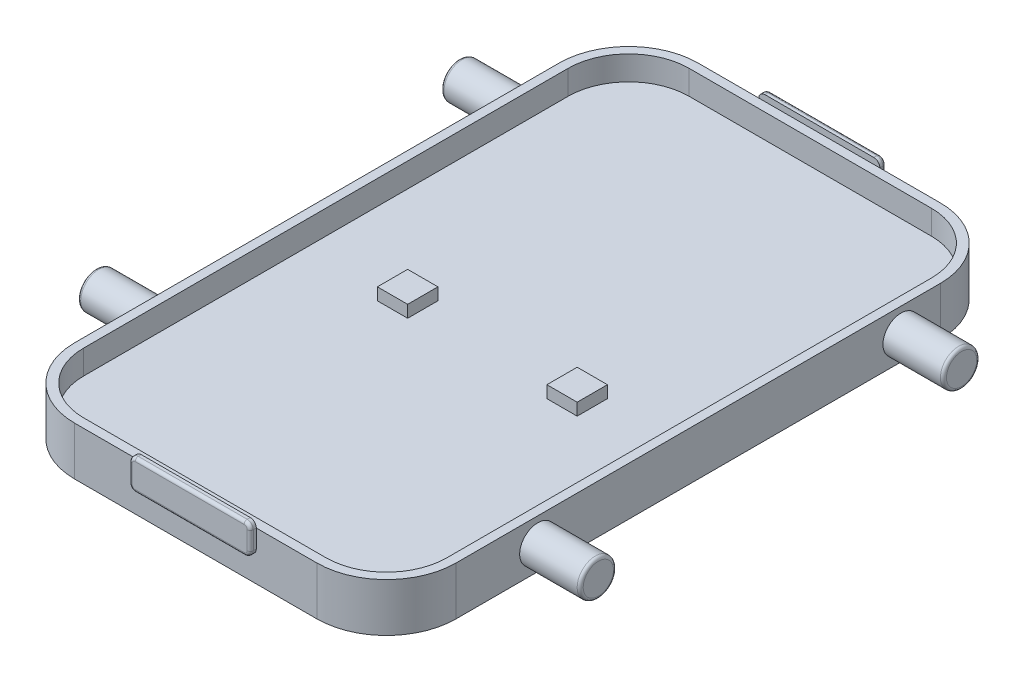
ISO-10303-21;
HEADER;
FILE_DESCRIPTION(('STEP AP214'),'2;1');
FILE_NAME('part.step','',(''),(''),'','','');
FILE_SCHEMA(('AUTOMOTIVE_DESIGN { 1 0 10303 214 1 1 1 1 }'));
ENDSEC;
DATA;
#1=APPLICATION_CONTEXT('core data for automotive mechanical design processes');
#2=APPLICATION_PROTOCOL_DEFINITION('international standard','automotive_design',2000,#1);
#3=PRODUCT_CONTEXT('',#1,'mechanical');
#4=PRODUCT('Part','Part','',(#3));
#5=PRODUCT_RELATED_PRODUCT_CATEGORY('part','',(#4));
#6=PRODUCT_DEFINITION_FORMATION('','',#4);
#7=PRODUCT_DEFINITION_CONTEXT('part definition',#1,'design');
#8=PRODUCT_DEFINITION('design','',#6,#7);
#9=PRODUCT_DEFINITION_SHAPE('','',#8);
#10=(LENGTH_UNIT() NAMED_UNIT(*) SI_UNIT(.MILLI.,.METRE.));
#11=(NAMED_UNIT(*) PLANE_ANGLE_UNIT() SI_UNIT($,.RADIAN.));
#12=(NAMED_UNIT(*) SI_UNIT($,.STERADIAN.) SOLID_ANGLE_UNIT());
#13=UNCERTAINTY_MEASURE_WITH_UNIT(LENGTH_MEASURE(1.E-05),#10,'distance_accuracy_value','');
#14=(GEOMETRIC_REPRESENTATION_CONTEXT(3) GLOBAL_UNCERTAINTY_ASSIGNED_CONTEXT((#13)) GLOBAL_UNIT_ASSIGNED_CONTEXT((#10,
#11,#12)) REPRESENTATION_CONTEXT('',''));
#15=CARTESIAN_POINT('',(0.,0.,0.));
#16=DIRECTION('',(0.,0.,1.));
#17=DIRECTION('',(1.,0.,0.));
#18=AXIS2_PLACEMENT_3D('',#15,#16,#17);
#19=CARTESIAN_POINT('',(20.,0.,-40.));
#20=DIRECTION('',(0.,1.,0.));
#21=DIRECTION('',(0.,0.,1.));
#22=AXIS2_PLACEMENT_3D('',#19,#20,#21);
#23=PLANE('',#22);
#24=DIRECTION('',(1.,0.,0.));
#25=VECTOR('',#24,1.);
#26=CARTESIAN_POINT('',(-16.5,0.,5.));
#27=LINE('',#26,#25);
#28=CARTESIAN_POINT('',(-16.5,0.,5.));
#29=VERTEX_POINT('',#28);
#30=CARTESIAN_POINT('',(-11.5,0.,5.));
#31=VERTEX_POINT('',#30);
#32=EDGE_CURVE('E377',#29,#31,#27,.T.);
#33=ORIENTED_EDGE('',*,*,#32,.F.);
#34=DIRECTION('',(0.,0.,1.));
#35=VECTOR('',#34,1.);
#36=CARTESIAN_POINT('',(-16.5,0.,0.));
#37=LINE('',#36,#35);
#38=CARTESIAN_POINT('',(-16.5,0.,0.));
#39=VERTEX_POINT('',#38);
#40=EDGE_CURVE('E374',#39,#29,#37,.T.);
#41=ORIENTED_EDGE('',*,*,#40,.F.);
#42=DIRECTION('',(-1.,0.,0.));
#43=VECTOR('',#42,1.);
#44=CARTESIAN_POINT('',(-16.5,0.,0.));
#45=LINE('',#44,#43);
#46=CARTESIAN_POINT('',(-11.5,0.,0.));
#47=VERTEX_POINT('',#46);
#48=EDGE_CURVE('E387',#47,#39,#45,.T.);
#49=ORIENTED_EDGE('',*,*,#48,.F.);
#50=DIRECTION('',(0.,0.,-1.));
#51=VECTOR('',#50,1.);
#52=CARTESIAN_POINT('',(-11.5,0.,0.));
#53=LINE('',#52,#51);
#54=EDGE_CURVE('E395',#31,#47,#53,.T.);
#55=ORIENTED_EDGE('',*,*,#54,.F.);
#56=EDGE_LOOP('',(#33,#41,#49,#55));
#57=FACE_BOUND('',#56,.T.);
#58=CARTESIAN_POINT('',(20.,0.,-40.));
#59=DIRECTION('',(0.,1.,0.));
#60=DIRECTION('',(0.,0.,1.));
#61=AXIS2_PLACEMENT_3D('',#58,#59,#60);
#62=CIRCLE('',#61,9.99999999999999);
#63=CARTESIAN_POINT('',(30.,0.,-40.));
#64=VERTEX_POINT('',#63);
#65=CARTESIAN_POINT('',(20.,0.,-50.));
#66=VERTEX_POINT('',#65);
#67=EDGE_CURVE('E446',#64,#66,#62,.T.);
#68=ORIENTED_EDGE('',*,*,#67,.T.);
#69=DIRECTION('',(-1.,0.,0.));
#70=VECTOR('',#69,1.);
#71=CARTESIAN_POINT('',(20.,0.,-50.));
#72=LINE('',#71,#70);
#73=CARTESIAN_POINT('',(-20.,0.,-50.));
#74=VERTEX_POINT('',#73);
#75=EDGE_CURVE('E449',#66,#74,#72,.T.);
#76=ORIENTED_EDGE('',*,*,#75,.T.);
#77=CARTESIAN_POINT('',(-20.,0.,-40.));
#78=DIRECTION('',(0.,1.,0.));
#79=DIRECTION('',(0.,0.,1.));
#80=AXIS2_PLACEMENT_3D('',#77,#78,#79);
#81=CIRCLE('',#80,10.);
#82=CARTESIAN_POINT('',(-30.,0.,-40.));
#83=VERTEX_POINT('',#82);
#84=EDGE_CURVE('E453',#74,#83,#81,.T.);
#85=ORIENTED_EDGE('',*,*,#84,.T.);
#86=DIRECTION('',(0.,0.,1.));
#87=VECTOR('',#86,1.);
#88=CARTESIAN_POINT('',(-30.,0.,-40.));
#89=LINE('',#88,#87);
#90=CARTESIAN_POINT('',(-30.,0.,40.));
#91=VERTEX_POINT('',#90);
#92=EDGE_CURVE('E456',#83,#91,#89,.T.);
#93=ORIENTED_EDGE('',*,*,#92,.T.);
#94=CARTESIAN_POINT('',(-20.,0.,40.));
#95=DIRECTION('',(0.,1.,0.));
#96=DIRECTION('',(0.,0.,1.));
#97=AXIS2_PLACEMENT_3D('',#94,#95,#96);
#98=CIRCLE('',#97,9.99999999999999);
#99=CARTESIAN_POINT('',(-20.,0.,50.));
#100=VERTEX_POINT('',#99);
#101=EDGE_CURVE('E459',#91,#100,#98,.T.);
#102=ORIENTED_EDGE('',*,*,#101,.T.);
#103=DIRECTION('',(1.,0.,0.));
#104=VECTOR('',#103,1.);
#105=CARTESIAN_POINT('',(-20.,0.,50.));
#106=LINE('',#105,#104);
#107=CARTESIAN_POINT('',(20.,0.,50.));
#108=VERTEX_POINT('',#107);
#109=EDGE_CURVE('E462',#100,#108,#106,.T.);
#110=ORIENTED_EDGE('',*,*,#109,.T.);
#111=CARTESIAN_POINT('',(20.,0.,40.));
#112=DIRECTION('',(0.,1.,0.));
#113=DIRECTION('',(0.,0.,1.));
#114=AXIS2_PLACEMENT_3D('',#111,#112,#113);
#115=CIRCLE('',#114,10.);
#116=CARTESIAN_POINT('',(30.,0.,40.));
#117=VERTEX_POINT('',#116);
#118=EDGE_CURVE('E465',#108,#117,#115,.T.);
#119=ORIENTED_EDGE('',*,*,#118,.T.);
#120=DIRECTION('',(0.,0.,-1.));
#121=VECTOR('',#120,1.);
#122=CARTESIAN_POINT('',(30.,0.,40.));
#123=LINE('',#122,#121);
#124=EDGE_CURVE('E468',#117,#64,#123,.T.);
#125=ORIENTED_EDGE('',*,*,#124,.T.);
#126=EDGE_LOOP('',(#68,#76,#85,#93,#102,#110,#119,#125));
#127=FACE_BOUND('',#126,.T.);
#128=DIRECTION('',(0.,0.,1.));
#129=VECTOR('',#128,1.);
#130=CARTESIAN_POINT('',(11.5,0.,0.));
#131=LINE('',#130,#129);
#132=CARTESIAN_POINT('',(11.5,0.,0.));
#133=VERTEX_POINT('',#132);
#134=CARTESIAN_POINT('',(11.5,0.,5.));
#135=VERTEX_POINT('',#134);
#136=EDGE_CURVE('E1724',#133,#135,#131,.T.);
#137=ORIENTED_EDGE('',*,*,#136,.F.);
#138=DIRECTION('',(-1.,0.,0.));
#139=VECTOR('',#138,1.);
#140=CARTESIAN_POINT('',(16.5,0.,0.));
#141=LINE('',#140,#139);
#142=CARTESIAN_POINT('',(16.5,0.,0.));
#143=VERTEX_POINT('',#142);
#144=EDGE_CURVE('E372',#143,#133,#141,.T.);
#145=ORIENTED_EDGE('',*,*,#144,.F.);
#146=DIRECTION('',(0.,0.,-1.));
#147=VECTOR('',#146,1.);
#148=CARTESIAN_POINT('',(16.5,0.,0.));
#149=LINE('',#148,#147);
#150=CARTESIAN_POINT('',(16.5,0.,5.));
#151=VERTEX_POINT('',#150);
#152=EDGE_CURVE('E368',#151,#143,#149,.T.);
#153=ORIENTED_EDGE('',*,*,#152,.F.);
#154=DIRECTION('',(1.,0.,0.));
#155=VECTOR('',#154,1.);
#156=CARTESIAN_POINT('',(16.5,0.,5.));
#157=LINE('',#156,#155);
#158=EDGE_CURVE('E1721',#135,#151,#157,.T.);
#159=ORIENTED_EDGE('',*,*,#158,.F.);
#160=EDGE_LOOP('',(#137,#145,#153,#159));
#161=FACE_BOUND('',#160,.T.);
#162=ADVANCED_FACE('F33',(#57,#127,#161),#23,.T.);
#163=CARTESIAN_POINT('',(-31.5,4.,51.5));
#164=DIRECTION('',(0.,0.,-1.));
#165=DIRECTION('',(-1.,0.,0.));
#166=AXIS2_PLACEMENT_3D('',#163,#164,#165);
#167=PLANE('',#166);
#168=DIRECTION('',(0.,-1.,0.));
#169=VECTOR('',#168,1.);
#170=CARTESIAN_POINT('',(-10.,5.,51.5));
#171=LINE('',#170,#169);
#172=CARTESIAN_POINT('',(-10.,4.,51.5));
#173=VERTEX_POINT('',#172);
#174=CARTESIAN_POINT('',(-10.,1.,51.5));
#175=VERTEX_POINT('',#174);
#176=EDGE_CURVE('E433',#173,#175,#171,.T.);
#177=ORIENTED_EDGE('',*,*,#176,.F.);
#178=DIRECTION('',(1.,0.,0.));
#179=VECTOR('',#178,1.);
#180=CARTESIAN_POINT('',(-31.5,4.,51.5));
#181=LINE('',#180,#179);
#182=CARTESIAN_POINT('',(-20.,4.,51.5));
#183=VERTEX_POINT('',#182);
#184=EDGE_CURVE('E524',#183,#173,#181,.T.);
#185=ORIENTED_EDGE('',*,*,#184,.F.);
#186=DIRECTION('',(0.,-1.,0.));
#187=VECTOR('',#186,1.);
#188=CARTESIAN_POINT('',(-20.,4.,51.5));
#189=LINE('',#188,#187);
#190=CARTESIAN_POINT('',(-20.,-4.,51.5));
#191=VERTEX_POINT('',#190);
#192=EDGE_CURVE('E582',#183,#191,#189,.T.);
#193=ORIENTED_EDGE('',*,*,#192,.T.);
#194=DIRECTION('',(1.,0.,0.));
#195=VECTOR('',#194,1.);
#196=CARTESIAN_POINT('',(-31.5,-4.,51.5));
#197=LINE('',#196,#195);
#198=CARTESIAN_POINT('',(20.,-4.,51.5));
#199=VERTEX_POINT('',#198);
#200=EDGE_CURVE('E539',#191,#199,#197,.T.);
#201=ORIENTED_EDGE('',*,*,#200,.T.);
#202=DIRECTION('',(0.,-1.,0.));
#203=VECTOR('',#202,1.);
#204=CARTESIAN_POINT('',(20.,4.,51.5));
#205=LINE('',#204,#203);
#206=CARTESIAN_POINT('',(20.,4.,51.5));
#207=VERTEX_POINT('',#206);
#208=EDGE_CURVE('E579',#199,#207,#205,.F.);
#209=ORIENTED_EDGE('',*,*,#208,.T.);
#210=CARTESIAN_POINT('',(10.,4.,51.5));
#211=VERTEX_POINT('',#210);
#212=EDGE_CURVE('E522',#211,#207,#181,.T.);
#213=ORIENTED_EDGE('',*,*,#212,.F.);
#214=DIRECTION('',(0.,1.,0.));
#215=VECTOR('',#214,1.);
#216=CARTESIAN_POINT('',(10.,5.,51.5));
#217=LINE('',#216,#215);
#218=CARTESIAN_POINT('',(10.,1.,51.5));
#219=VERTEX_POINT('',#218);
#220=EDGE_CURVE('E439',#219,#211,#217,.T.);
#221=ORIENTED_EDGE('',*,*,#220,.F.);
#222=CARTESIAN_POINT('',(9.,1.,51.5));
#223=DIRECTION('',(0.,0.,-1.));
#224=DIRECTION('',(-1.,0.,0.));
#225=AXIS2_PLACEMENT_3D('',#222,#223,#224);
#226=CIRCLE('',#225,1.);
#227=CARTESIAN_POINT('',(9.,0.,51.5));
#228=VERTEX_POINT('',#227);
#229=EDGE_CURVE('E610',#219,#228,#226,.T.);
#230=ORIENTED_EDGE('',*,*,#229,.T.);
#231=DIRECTION('',(1.,0.,0.));
#232=VECTOR('',#231,1.);
#233=CARTESIAN_POINT('',(-10.,0.,51.5));
#234=LINE('',#233,#232);
#235=CARTESIAN_POINT('',(-9.,0.,51.5));
#236=VERTEX_POINT('',#235);
#237=EDGE_CURVE('E436',#236,#228,#234,.T.);
#238=ORIENTED_EDGE('',*,*,#237,.F.);
#239=CARTESIAN_POINT('',(-9.,1.,51.5));
#240=DIRECTION('',(0.,0.,-1.));
#241=DIRECTION('',(-1.,0.,0.));
#242=AXIS2_PLACEMENT_3D('',#239,#240,#241);
#243=CIRCLE('',#242,1.);
#244=EDGE_CURVE('E612',#236,#175,#243,.T.);
#245=ORIENTED_EDGE('',*,*,#244,.T.);
#246=EDGE_LOOP('',(#177,#185,#193,#201,#209,#213,#221,#230,#238,#245));
#247=FACE_BOUND('',#246,.T.);
#248=ADVANCED_FACE('F800',(#247),#167,.F.);
#249=CARTESIAN_POINT('',(-31.5,4.,-51.5));
#250=DIRECTION('',(1.,0.,0.));
#251=DIRECTION('',(0.,0.,-1.));
#252=AXIS2_PLACEMENT_3D('',#249,#250,#251);
#253=PLANE('',#252);
#254=CARTESIAN_POINT('',(-31.5,0.,26.5));
#255=DIRECTION('',(1.,0.,0.));
#256=DIRECTION('',(0.,0.,-1.));
#257=AXIS2_PLACEMENT_3D('',#254,#255,#256);
#258=CIRCLE('',#257,3.);
#259=CARTESIAN_POINT('',(-31.5,0.,23.5));
#260=VERTEX_POINT('',#259);
#261=EDGE_CURVE('E515',#260,#260,#258,.F.);
#262=ORIENTED_EDGE('',*,*,#261,.F.);
#263=EDGE_LOOP('',(#262));
#264=FACE_BOUND('',#263,.T.);
#265=DIRECTION('',(0.,0.,1.));
#266=VECTOR('',#265,1.);
#267=CARTESIAN_POINT('',(-31.5,4.,-51.5));
#268=LINE('',#267,#266);
#269=CARTESIAN_POINT('',(-31.5,4.,-40.));
#270=VERTEX_POINT('',#269);
#271=CARTESIAN_POINT('',(-31.5,4.,40.));
#272=VERTEX_POINT('',#271);
#273=EDGE_CURVE('E519',#270,#272,#268,.T.);
#274=ORIENTED_EDGE('',*,*,#273,.F.);
#275=DIRECTION('',(0.,-1.,0.));
#276=VECTOR('',#275,1.);
#277=CARTESIAN_POINT('',(-31.5,4.,-40.));
#278=LINE('',#277,#276);
#279=CARTESIAN_POINT('',(-31.5,-4.,-40.));
#280=VERTEX_POINT('',#279);
#281=EDGE_CURVE('E548',#270,#280,#278,.T.);
#282=ORIENTED_EDGE('',*,*,#281,.T.);
#283=DIRECTION('',(0.,0.,1.));
#284=VECTOR('',#283,1.);
#285=CARTESIAN_POINT('',(-31.5,-4.,-51.5));
#286=LINE('',#285,#284);
#287=CARTESIAN_POINT('',(-31.5,-4.,40.));
#288=VERTEX_POINT('',#287);
#289=EDGE_CURVE('E495',#280,#288,#286,.T.);
#290=ORIENTED_EDGE('',*,*,#289,.T.);
#291=DIRECTION('',(0.,-1.,0.));
#292=VECTOR('',#291,1.);
#293=CARTESIAN_POINT('',(-31.5,4.,40.));
#294=LINE('',#293,#292);
#295=EDGE_CURVE('E535',#288,#272,#294,.F.);
#296=ORIENTED_EDGE('',*,*,#295,.T.);
#297=EDGE_LOOP('',(#274,#282,#290,#296));
#298=FACE_BOUND('',#297,.T.);
#299=CARTESIAN_POINT('',(-31.5,0.,-33.5));
#300=DIRECTION('',(1.,0.,0.));
#301=DIRECTION('',(0.,0.,-1.));
#302=AXIS2_PLACEMENT_3D('',#299,#300,#301);
#303=CIRCLE('',#302,3.);
#304=CARTESIAN_POINT('',(-31.5,0.,-36.5));
#305=VERTEX_POINT('',#304);
#306=EDGE_CURVE('E510',#305,#305,#303,.F.);
#307=ORIENTED_EDGE('',*,*,#306,.F.);
#308=EDGE_LOOP('',(#307));
#309=FACE_BOUND('',#308,.T.);
#310=ADVANCED_FACE('F864',(#264,#298,#309),#253,.F.);
#311=CARTESIAN_POINT('',(31.5,4.,-51.5));
#312=DIRECTION('',(-1.,0.,0.));
#313=DIRECTION('',(0.,0.,1.));
#314=AXIS2_PLACEMENT_3D('',#311,#312,#313);
#315=PLANE('',#314);
#316=CARTESIAN_POINT('',(31.5,0.,26.5));
#317=DIRECTION('',(-1.,0.,0.));
#318=DIRECTION('',(0.,0.,1.));
#319=AXIS2_PLACEMENT_3D('',#316,#317,#318);
#320=CIRCLE('',#319,3.);
#321=CARTESIAN_POINT('',(31.5,0.,29.5));
#322=VERTEX_POINT('',#321);
#323=EDGE_CURVE('E518',#322,#322,#320,.F.);
#324=ORIENTED_EDGE('',*,*,#323,.F.);
#325=EDGE_LOOP('',(#324));
#326=FACE_BOUND('',#325,.T.);
#327=DIRECTION('',(0.,0.,-1.));
#328=VECTOR('',#327,1.);
#329=CARTESIAN_POINT('',(31.5,-4.,-51.5));
#330=LINE('',#329,#328);
#331=CARTESIAN_POINT('',(31.5,-4.,40.));
#332=VERTEX_POINT('',#331);
#333=CARTESIAN_POINT('',(31.5,-4.,-40.));
#334=VERTEX_POINT('',#333);
#335=EDGE_CURVE('E542',#332,#334,#330,.T.);
#336=ORIENTED_EDGE('',*,*,#335,.T.);
#337=DIRECTION('',(0.,-1.,0.));
#338=VECTOR('',#337,1.);
#339=CARTESIAN_POINT('',(31.5,4.,-40.));
#340=LINE('',#339,#338);
#341=CARTESIAN_POINT('',(31.5,4.,-40.));
#342=VERTEX_POINT('',#341);
#343=EDGE_CURVE('E577',#334,#342,#340,.F.);
#344=ORIENTED_EDGE('',*,*,#343,.T.);
#345=DIRECTION('',(0.,0.,-1.));
#346=VECTOR('',#345,1.);
#347=CARTESIAN_POINT('',(31.5,4.,-51.5));
#348=LINE('',#347,#346);
#349=CARTESIAN_POINT('',(31.5,4.,40.));
#350=VERTEX_POINT('',#349);
#351=EDGE_CURVE('E527',#350,#342,#348,.T.);
#352=ORIENTED_EDGE('',*,*,#351,.F.);
#353=DIRECTION('',(0.,-1.,0.));
#354=VECTOR('',#353,1.);
#355=CARTESIAN_POINT('',(31.5,4.,40.));
#356=LINE('',#355,#354);
#357=EDGE_CURVE('E574',#350,#332,#356,.T.);
#358=ORIENTED_EDGE('',*,*,#357,.T.);
#359=EDGE_LOOP('',(#336,#344,#352,#358));
#360=FACE_BOUND('',#359,.T.);
#361=CARTESIAN_POINT('',(31.5,0.,-33.5));
#362=DIRECTION('',(-1.,0.,0.));
#363=DIRECTION('',(0.,0.,1.));
#364=AXIS2_PLACEMENT_3D('',#361,#362,#363);
#365=CIRCLE('',#364,3.);
#366=CARTESIAN_POINT('',(31.5,0.,-30.5));
#367=VERTEX_POINT('',#366);
#368=EDGE_CURVE('E514',#367,#367,#365,.F.);
#369=ORIENTED_EDGE('',*,*,#368,.F.);
#370=EDGE_LOOP('',(#369));
#371=FACE_BOUND('',#370,.T.);
#372=ADVANCED_FACE('F941',(#326,#360,#371),#315,.F.);
#373=CARTESIAN_POINT('',(-31.5,4.,-51.5));
#374=DIRECTION('',(0.,0.,1.));
#375=DIRECTION('',(1.,0.,0.));
#376=AXIS2_PLACEMENT_3D('',#373,#374,#375);
#377=PLANE('',#376);
#378=DIRECTION('',(-1.,0.,0.));
#379=VECTOR('',#378,1.);
#380=CARTESIAN_POINT('',(-31.5,-4.,-51.5));
#381=LINE('',#380,#379);
#382=CARTESIAN_POINT('',(20.,-4.,-51.5));
#383=VERTEX_POINT('',#382);
#384=CARTESIAN_POINT('',(-15.,-4.,-51.5));
#385=VERTEX_POINT('',#384);
#386=EDGE_CURVE('E523',#383,#385,#381,.T.);
#387=ORIENTED_EDGE('',*,*,#386,.T.);
#388=CARTESIAN_POINT('',(-17.5,-4.,-51.5));
#389=DIRECTION('',(0.,0.,1.));
#390=DIRECTION('',(1.,0.,0.));
#391=AXIS2_PLACEMENT_3D('',#388,#389,#390);
#392=CIRCLE('',#391,2.5);
#393=CARTESIAN_POINT('',(-20.,-4.,-51.5));
#394=VERTEX_POINT('',#393);
#395=EDGE_CURVE('E417',#385,#394,#392,.T.);
#396=ORIENTED_EDGE('',*,*,#395,.T.);
#397=DIRECTION('',(0.,-1.,0.));
#398=VECTOR('',#397,1.);
#399=CARTESIAN_POINT('',(-20.,4.,-51.5));
#400=LINE('',#399,#398);
#401=CARTESIAN_POINT('',(-20.,4.,-51.5));
#402=VERTEX_POINT('',#401);
#403=EDGE_CURVE('E563',#394,#402,#400,.F.);
#404=ORIENTED_EDGE('',*,*,#403,.T.);
#405=DIRECTION('',(-1.,0.,0.));
#406=VECTOR('',#405,1.);
#407=CARTESIAN_POINT('',(-31.5,4.,-51.5));
#408=LINE('',#407,#406);
#409=CARTESIAN_POINT('',(-10.,4.,-51.5));
#410=VERTEX_POINT('',#409);
#411=EDGE_CURVE('E531',#410,#402,#408,.T.);
#412=ORIENTED_EDGE('',*,*,#411,.F.);
#413=DIRECTION('',(0.,-1.,0.));
#414=VECTOR('',#413,1.);
#415=CARTESIAN_POINT('',(-10.,5.,-51.5));
#416=LINE('',#415,#414);
#417=CARTESIAN_POINT('',(-10.,1.,-51.5));
#418=VERTEX_POINT('',#417);
#419=EDGE_CURVE('E421',#410,#418,#416,.T.);
#420=ORIENTED_EDGE('',*,*,#419,.T.);
#421=CARTESIAN_POINT('',(-9.,1.,-51.5));
#422=DIRECTION('',(0.,0.,1.));
#423=DIRECTION('',(1.,0.,0.));
#424=AXIS2_PLACEMENT_3D('',#421,#422,#423);
#425=CIRCLE('',#424,1.);
#426=CARTESIAN_POINT('',(-9.,0.,-51.5));
#427=VERTEX_POINT('',#426);
#428=EDGE_CURVE('E640',#418,#427,#425,.T.);
#429=ORIENTED_EDGE('',*,*,#428,.T.);
#430=DIRECTION('',(1.,0.,0.));
#431=VECTOR('',#430,1.);
#432=CARTESIAN_POINT('',(-10.,0.,-51.5));
#433=LINE('',#432,#431);
#434=CARTESIAN_POINT('',(9.,0.,-51.5));
#435=VERTEX_POINT('',#434);
#436=EDGE_CURVE('E430',#427,#435,#433,.T.);
#437=ORIENTED_EDGE('',*,*,#436,.T.);
#438=CARTESIAN_POINT('',(9.,1.,-51.5));
#439=DIRECTION('',(0.,0.,1.));
#440=DIRECTION('',(1.,0.,0.));
#441=AXIS2_PLACEMENT_3D('',#438,#439,#440);
#442=CIRCLE('',#441,1.);
#443=CARTESIAN_POINT('',(10.,1.,-51.5));
#444=VERTEX_POINT('',#443);
#445=EDGE_CURVE('E638',#435,#444,#442,.T.);
#446=ORIENTED_EDGE('',*,*,#445,.T.);
#447=DIRECTION('',(0.,1.,0.));
#448=VECTOR('',#447,1.);
#449=CARTESIAN_POINT('',(10.,5.,-51.5));
#450=LINE('',#449,#448);
#451=CARTESIAN_POINT('',(10.,4.,-51.5));
#452=VERTEX_POINT('',#451);
#453=EDGE_CURVE('E427',#444,#452,#450,.T.);
#454=ORIENTED_EDGE('',*,*,#453,.T.);
#455=CARTESIAN_POINT('',(20.,4.,-51.5));
#456=VERTEX_POINT('',#455);
#457=EDGE_CURVE('E532',#456,#452,#408,.T.);
#458=ORIENTED_EDGE('',*,*,#457,.F.);
#459=DIRECTION('',(0.,-1.,0.));
#460=VECTOR('',#459,1.);
#461=CARTESIAN_POINT('',(20.,4.,-51.5));
#462=LINE('',#461,#460);
#463=EDGE_CURVE('E560',#456,#383,#462,.T.);
#464=ORIENTED_EDGE('',*,*,#463,.T.);
#465=EDGE_LOOP('',(#387,#396,#404,#412,#420,#429,#437,#446,#454,#458,#464));
#466=FACE_BOUND('',#465,.T.);
#467=ADVANCED_FACE('F933',(#466),#377,.F.);
#468=CARTESIAN_POINT('',(-31.5,4.,51.5));
#469=DIRECTION('',(0.,1.,0.));
#470=DIRECTION('',(0.,0.,1.));
#471=AXIS2_PLACEMENT_3D('',#468,#469,#470);
#472=PLANE('',#471);
#473=CARTESIAN_POINT('',(20.,4.,-40.));
#474=DIRECTION('',(0.,1.,0.));
#475=DIRECTION('',(0.,0.,1.));
#476=AXIS2_PLACEMENT_3D('',#473,#474,#475);
#477=CIRCLE('',#476,9.99999999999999);
#478=CARTESIAN_POINT('',(30.,4.,-40.));
#479=VERTEX_POINT('',#478);
#480=CARTESIAN_POINT('',(20.,4.,-50.));
#481=VERTEX_POINT('',#480);
#482=EDGE_CURVE('E445',#479,#481,#477,.T.);
#483=ORIENTED_EDGE('',*,*,#482,.F.);
#484=DIRECTION('',(0.,0.,-1.));
#485=VECTOR('',#484,1.);
#486=CARTESIAN_POINT('',(30.,4.,40.));
#487=LINE('',#486,#485);
#488=CARTESIAN_POINT('',(30.,4.,40.));
#489=VERTEX_POINT('',#488);
#490=EDGE_CURVE('E450',#489,#479,#487,.T.);
#491=ORIENTED_EDGE('',*,*,#490,.F.);
#492=CARTESIAN_POINT('',(20.,4.,40.));
#493=DIRECTION('',(0.,1.,0.));
#494=DIRECTION('',(0.,0.,1.));
#495=AXIS2_PLACEMENT_3D('',#492,#493,#494);
#496=CIRCLE('',#495,10.);
#497=CARTESIAN_POINT('',(20.,4.,50.));
#498=VERTEX_POINT('',#497);
#499=EDGE_CURVE('E488',#498,#489,#496,.T.);
#500=ORIENTED_EDGE('',*,*,#499,.F.);
#501=DIRECTION('',(1.,0.,0.));
#502=VECTOR('',#501,1.);
#503=CARTESIAN_POINT('',(-20.,4.,50.));
#504=LINE('',#503,#502);
#505=CARTESIAN_POINT('',(-20.,4.,50.));
#506=VERTEX_POINT('',#505);
#507=EDGE_CURVE('E485',#506,#498,#504,.T.);
#508=ORIENTED_EDGE('',*,*,#507,.F.);
#509=CARTESIAN_POINT('',(-20.,4.,40.));
#510=DIRECTION('',(0.,1.,0.));
#511=DIRECTION('',(0.,0.,1.));
#512=AXIS2_PLACEMENT_3D('',#509,#510,#511);
#513=CIRCLE('',#512,9.99999999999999);
#514=CARTESIAN_POINT('',(-30.,4.,40.));
#515=VERTEX_POINT('',#514);
#516=EDGE_CURVE('E482',#515,#506,#513,.T.);
#517=ORIENTED_EDGE('',*,*,#516,.F.);
#518=DIRECTION('',(0.,0.,1.));
#519=VECTOR('',#518,1.);
#520=CARTESIAN_POINT('',(-30.,4.,-40.));
#521=LINE('',#520,#519);
#522=CARTESIAN_POINT('',(-30.,4.,-40.));
#523=VERTEX_POINT('',#522);
#524=EDGE_CURVE('E479',#523,#515,#521,.T.);
#525=ORIENTED_EDGE('',*,*,#524,.F.);
#526=CARTESIAN_POINT('',(-20.,4.,-40.));
#527=DIRECTION('',(0.,1.,0.));
#528=DIRECTION('',(0.,0.,1.));
#529=AXIS2_PLACEMENT_3D('',#526,#527,#528);
#530=CIRCLE('',#529,10.);
#531=CARTESIAN_POINT('',(-20.,4.,-50.));
#532=VERTEX_POINT('',#531);
#533=EDGE_CURVE('E476',#532,#523,#530,.T.);
#534=ORIENTED_EDGE('',*,*,#533,.F.);
#535=DIRECTION('',(-1.,0.,0.));
#536=VECTOR('',#535,1.);
#537=CARTESIAN_POINT('',(20.,4.,-50.));
#538=LINE('',#537,#536);
#539=EDGE_CURVE('E473',#481,#532,#538,.T.);
#540=ORIENTED_EDGE('',*,*,#539,.F.);
#541=EDGE_LOOP('',(#483,#491,#500,#508,#517,#525,#534,#540));
#542=FACE_BOUND('',#541,.T.);
#543=ORIENTED_EDGE('',*,*,#457,.T.);
#544=EDGE_CURVE('E536',#452,#410,#408,.T.);
#545=ORIENTED_EDGE('',*,*,#544,.T.);
#546=ORIENTED_EDGE('',*,*,#411,.T.);
#547=CARTESIAN_POINT('',(-20.,4.,-40.));
#548=DIRECTION('',(0.,1.,0.));
#549=DIRECTION('',(0.,0.,1.));
#550=AXIS2_PLACEMENT_3D('',#547,#548,#549);
#551=CIRCLE('',#550,11.5);
#552=EDGE_CURVE('E572',#402,#270,#551,.T.);
#553=ORIENTED_EDGE('',*,*,#552,.T.);
#554=ORIENTED_EDGE('',*,*,#273,.T.);
#555=CARTESIAN_POINT('',(-20.,4.,40.));
#556=DIRECTION('',(0.,1.,0.));
#557=DIRECTION('',(0.,0.,1.));
#558=AXIS2_PLACEMENT_3D('',#555,#556,#557);
#559=CIRCLE('',#558,11.5);
#560=EDGE_CURVE('E568',#272,#183,#559,.T.);
#561=ORIENTED_EDGE('',*,*,#560,.T.);
#562=ORIENTED_EDGE('',*,*,#184,.T.);
#563=EDGE_CURVE('E528',#173,#211,#181,.T.);
#564=ORIENTED_EDGE('',*,*,#563,.T.);
#565=ORIENTED_EDGE('',*,*,#212,.T.);
#566=CARTESIAN_POINT('',(20.,4.,40.));
#567=DIRECTION('',(0.,1.,0.));
#568=DIRECTION('',(0.,0.,1.));
#569=AXIS2_PLACEMENT_3D('',#566,#567,#568);
#570=CIRCLE('',#569,11.5);
#571=EDGE_CURVE('E566',#207,#350,#570,.T.);
#572=ORIENTED_EDGE('',*,*,#571,.T.);
#573=ORIENTED_EDGE('',*,*,#351,.T.);
#574=CARTESIAN_POINT('',(20.,4.,-40.));
#575=DIRECTION('',(0.,1.,0.));
#576=DIRECTION('',(0.,0.,1.));
#577=AXIS2_PLACEMENT_3D('',#574,#575,#576);
#578=CIRCLE('',#577,11.5);
#579=EDGE_CURVE('E570',#342,#456,#578,.T.);
#580=ORIENTED_EDGE('',*,*,#579,.T.);
#581=EDGE_LOOP('',(#543,#545,#546,#553,#554,#561,#562,#564,#565,#572,#573,#580));
#582=FACE_BOUND('',#581,.T.);
#583=ADVANCED_FACE('F805',(#542,#582),#472,.T.);
#584=CARTESIAN_POINT('',(-31.5,-4.,51.5));
#585=DIRECTION('',(0.,1.,0.));
#586=DIRECTION('',(0.,0.,1.));
#587=AXIS2_PLACEMENT_3D('',#584,#585,#586);
#588=PLANE('',#587);
#589=DIRECTION('',(0.,0.,-1.));
#590=VECTOR('',#589,1.);
#591=CARTESIAN_POINT('',(-20.,-4.,-41.5));
#592=LINE('',#591,#590);
#593=CARTESIAN_POINT('',(-20.,-4.,-41.5));
#594=VERTEX_POINT('',#593);
#595=EDGE_CURVE('E414',#394,#594,#592,.F.);
#596=ORIENTED_EDGE('',*,*,#595,.T.);
#597=CARTESIAN_POINT('',(-17.5,-4.,-41.5));
#598=DIRECTION('',(0.,1.,0.));
#599=DIRECTION('',(0.,0.,1.));
#600=AXIS2_PLACEMENT_3D('',#597,#598,#599);
#601=CIRCLE('',#600,2.5);
#602=CARTESIAN_POINT('',(-15.,-4.,-41.5));
#603=VERTEX_POINT('',#602);
#604=EDGE_CURVE('E408',#594,#603,#601,.T.);
#605=ORIENTED_EDGE('',*,*,#604,.T.);
#606=DIRECTION('',(0.,0.,-1.));
#607=VECTOR('',#606,1.);
#608=CARTESIAN_POINT('',(-15.,-4.,-41.5));
#609=LINE('',#608,#607);
#610=EDGE_CURVE('E419',#603,#385,#609,.T.);
#611=ORIENTED_EDGE('',*,*,#610,.T.);
#612=ORIENTED_EDGE('',*,*,#386,.F.);
#613=CARTESIAN_POINT('',(20.,-4.,-40.));
#614=DIRECTION('',(0.,1.,0.));
#615=DIRECTION('',(0.,0.,1.));
#616=AXIS2_PLACEMENT_3D('',#613,#614,#615);
#617=CIRCLE('',#616,11.5);
#618=EDGE_CURVE('E555',#383,#334,#617,.F.);
#619=ORIENTED_EDGE('',*,*,#618,.T.);
#620=ORIENTED_EDGE('',*,*,#335,.F.);
#621=CARTESIAN_POINT('',(20.,-4.,40.));
#622=DIRECTION('',(0.,1.,0.));
#623=DIRECTION('',(0.,0.,1.));
#624=AXIS2_PLACEMENT_3D('',#621,#622,#623);
#625=CIRCLE('',#624,11.5);
#626=EDGE_CURVE('E551',#332,#199,#625,.F.);
#627=ORIENTED_EDGE('',*,*,#626,.T.);
#628=ORIENTED_EDGE('',*,*,#200,.F.);
#629=CARTESIAN_POINT('',(-20.,-4.,40.));
#630=DIRECTION('',(0.,1.,0.));
#631=DIRECTION('',(0.,0.,1.));
#632=AXIS2_PLACEMENT_3D('',#629,#630,#631);
#633=CIRCLE('',#632,11.5);
#634=EDGE_CURVE('E553',#191,#288,#633,.F.);
#635=ORIENTED_EDGE('',*,*,#634,.T.);
#636=ORIENTED_EDGE('',*,*,#289,.F.);
#637=CARTESIAN_POINT('',(-20.,-4.,-40.));
#638=DIRECTION('',(0.,1.,0.));
#639=DIRECTION('',(0.,0.,1.));
#640=AXIS2_PLACEMENT_3D('',#637,#638,#639);
#641=CIRCLE('',#640,11.5);
#642=EDGE_CURVE('E557',#280,#394,#641,.F.);
#643=ORIENTED_EDGE('',*,*,#642,.T.);
#644=EDGE_LOOP('',(#596,#605,#611,#612,#619,#620,#627,#628,#635,#636,#643));
#645=FACE_BOUND('',#644,.T.);
#646=ADVANCED_FACE('F932',(#645),#588,.F.);
#647=CARTESIAN_POINT('',(-20.,4.,-40.));
#648=DIRECTION('',(0.,-1.,0.));
#649=DIRECTION('',(0.,0.,-1.));
#650=AXIS2_PLACEMENT_3D('',#647,#648,#649);
#651=CYLINDRICAL_SURFACE('',#650,11.5);
#652=ORIENTED_EDGE('',*,*,#552,.F.);
#653=ORIENTED_EDGE('',*,*,#403,.F.);
#654=ORIENTED_EDGE('',*,*,#642,.F.);
#655=ORIENTED_EDGE('',*,*,#281,.F.);
#656=EDGE_LOOP('',(#652,#653,#654,#655));
#657=FACE_BOUND('',#656,.T.);
#658=ADVANCED_FACE('F937',(#657),#651,.T.);
#659=CARTESIAN_POINT('',(20.,4.,-40.));
#660=DIRECTION('',(0.,-1.,0.));
#661=DIRECTION('',(0.,0.,-1.));
#662=AXIS2_PLACEMENT_3D('',#659,#660,#661);
#663=CYLINDRICAL_SURFACE('',#662,11.5);
#664=ORIENTED_EDGE('',*,*,#579,.F.);
#665=ORIENTED_EDGE('',*,*,#343,.F.);
#666=ORIENTED_EDGE('',*,*,#618,.F.);
#667=ORIENTED_EDGE('',*,*,#463,.F.);
#668=EDGE_LOOP('',(#664,#665,#666,#667));
#669=FACE_BOUND('',#668,.T.);
#670=ADVANCED_FACE('F951',(#669),#663,.T.);
#671=CARTESIAN_POINT('',(-20.,4.,40.));
#672=DIRECTION('',(0.,-1.,0.));
#673=DIRECTION('',(0.,0.,-1.));
#674=AXIS2_PLACEMENT_3D('',#671,#672,#673);
#675=CYLINDRICAL_SURFACE('',#674,11.5);
#676=ORIENTED_EDGE('',*,*,#560,.F.);
#677=ORIENTED_EDGE('',*,*,#295,.F.);
#678=ORIENTED_EDGE('',*,*,#634,.F.);
#679=ORIENTED_EDGE('',*,*,#192,.F.);
#680=EDGE_LOOP('',(#676,#677,#678,#679));
#681=FACE_BOUND('',#680,.T.);
#682=ADVANCED_FACE('F955',(#681),#675,.T.);
#683=CARTESIAN_POINT('',(20.,4.,40.));
#684=DIRECTION('',(0.,-1.,0.));
#685=DIRECTION('',(0.,0.,-1.));
#686=AXIS2_PLACEMENT_3D('',#683,#684,#685);
#687=CYLINDRICAL_SURFACE('',#686,11.5);
#688=ORIENTED_EDGE('',*,*,#571,.F.);
#689=ORIENTED_EDGE('',*,*,#208,.F.);
#690=ORIENTED_EDGE('',*,*,#626,.F.);
#691=ORIENTED_EDGE('',*,*,#357,.F.);
#692=EDGE_LOOP('',(#688,#689,#690,#691));
#693=FACE_BOUND('',#692,.T.);
#694=ADVANCED_FACE('F921',(#693),#687,.T.);
#695=CARTESIAN_POINT('',(41.5,0.,26.5));
#696=DIRECTION('',(1.,0.,0.));
#697=DIRECTION('',(0.,0.,-1.));
#698=AXIS2_PLACEMENT_3D('',#695,#696,#697);
#699=PLANE('',#698);
#700=CARTESIAN_POINT('',(41.5,0.,26.5));
#701=DIRECTION('',(1.,0.,0.));
#702=DIRECTION('',(0.,0.,-1.));
#703=AXIS2_PLACEMENT_3D('',#700,#701,#702);
#704=CIRCLE('',#703,2.5);
#705=CARTESIAN_POINT('',(41.5,0.,24.));
#706=VERTEX_POINT('',#705);
#707=EDGE_CURVE('E700',#706,#706,#704,.T.);
#708=ORIENTED_EDGE('',*,*,#707,.T.);
#709=EDGE_LOOP('',(#708));
#710=FACE_BOUND('',#709,.T.);
#711=ADVANCED_FACE('F917',(#710),#699,.T.);
#712=CARTESIAN_POINT('',(41.5,0.,26.5));
#713=DIRECTION('',(-1.,0.,0.));
#714=DIRECTION('',(0.,0.,1.));
#715=AXIS2_PLACEMENT_3D('',#712,#713,#714);
#716=CYLINDRICAL_SURFACE('',#715,3.);
#717=CARTESIAN_POINT('',(41.,0.,26.5));
#718=DIRECTION('',(1.,0.,0.));
#719=DIRECTION('',(0.,0.,-1.));
#720=AXIS2_PLACEMENT_3D('',#717,#718,#719);
#721=CIRCLE('',#720,3.);
#722=CARTESIAN_POINT('',(41.,0.,23.5));
#723=VERTEX_POINT('',#722);
#724=EDGE_CURVE('E703',#723,#723,#721,.F.);
#725=ORIENTED_EDGE('',*,*,#724,.T.);
#726=EDGE_LOOP('',(#725));
#727=FACE_BOUND('',#726,.T.);
#728=ORIENTED_EDGE('',*,*,#323,.T.);
#729=EDGE_LOOP('',(#728));
#730=FACE_BOUND('',#729,.T.);
#731=ADVANCED_FACE('F920',(#727,#730),#716,.T.);
#732=CARTESIAN_POINT('',(-41.,0.,26.5));
#733=DIRECTION('',(1.,0.,0.));
#734=DIRECTION('',(0.,0.,-1.));
#735=AXIS2_PLACEMENT_3D('',#732,#733,#734);
#736=CIRCLE('',#735,3.);
#737=CARTESIAN_POINT('',(-41.,0.,23.5));
#738=VERTEX_POINT('',#737);
#739=EDGE_CURVE('E688',#738,#738,#736,.T.);
#740=ORIENTED_EDGE('',*,*,#739,.T.);
#741=EDGE_LOOP('',(#740));
#742=FACE_BOUND('',#741,.T.);
#743=ORIENTED_EDGE('',*,*,#261,.T.);
#744=EDGE_LOOP('',(#743));
#745=FACE_BOUND('',#744,.T.);
#746=ADVANCED_FACE('F925',(#742,#745),#716,.T.);
#747=CARTESIAN_POINT('',(-41.5,0.,26.5));
#748=DIRECTION('',(1.,0.,0.));
#749=DIRECTION('',(0.,0.,-1.));
#750=AXIS2_PLACEMENT_3D('',#747,#748,#749);
#751=PLANE('',#750);
#752=CARTESIAN_POINT('',(-41.5,0.,26.5));
#753=DIRECTION('',(1.,0.,0.));
#754=DIRECTION('',(0.,0.,-1.));
#755=AXIS2_PLACEMENT_3D('',#752,#753,#754);
#756=CIRCLE('',#755,2.5);
#757=CARTESIAN_POINT('',(-41.5,0.,24.));
#758=VERTEX_POINT('',#757);
#759=EDGE_CURVE('E691',#758,#758,#756,.F.);
#760=ORIENTED_EDGE('',*,*,#759,.T.);
#761=EDGE_LOOP('',(#760));
#762=FACE_BOUND('',#761,.T.);
#763=ADVANCED_FACE('F908',(#762),#751,.F.);
#764=CARTESIAN_POINT('',(41.5,0.,-33.5));
#765=DIRECTION('',(1.,0.,0.));
#766=DIRECTION('',(0.,0.,-1.));
#767=AXIS2_PLACEMENT_3D('',#764,#765,#766);
#768=PLANE('',#767);
#769=CARTESIAN_POINT('',(41.5,0.,-33.5));
#770=DIRECTION('',(1.,0.,0.));
#771=DIRECTION('',(0.,0.,-1.));
#772=AXIS2_PLACEMENT_3D('',#769,#770,#771);
#773=CIRCLE('',#772,2.5);
#774=CARTESIAN_POINT('',(41.5,0.,-36.));
#775=VERTEX_POINT('',#774);
#776=EDGE_CURVE('E694',#775,#775,#773,.T.);
#777=ORIENTED_EDGE('',*,*,#776,.T.);
#778=EDGE_LOOP('',(#777));
#779=FACE_BOUND('',#778,.T.);
#780=ADVANCED_FACE('F904',(#779),#768,.T.);
#781=CARTESIAN_POINT('',(41.5,0.,-33.5));
#782=DIRECTION('',(-1.,0.,0.));
#783=DIRECTION('',(0.,0.,1.));
#784=AXIS2_PLACEMENT_3D('',#781,#782,#783);
#785=CYLINDRICAL_SURFACE('',#784,3.);
#786=CARTESIAN_POINT('',(41.,0.,-33.5));
#787=DIRECTION('',(1.,0.,0.));
#788=DIRECTION('',(0.,0.,-1.));
#789=AXIS2_PLACEMENT_3D('',#786,#787,#788);
#790=CIRCLE('',#789,3.);
#791=CARTESIAN_POINT('',(41.,0.,-36.5));
#792=VERTEX_POINT('',#791);
#793=EDGE_CURVE('E697',#792,#792,#790,.F.);
#794=ORIENTED_EDGE('',*,*,#793,.T.);
#795=EDGE_LOOP('',(#794));
#796=FACE_BOUND('',#795,.T.);
#797=ORIENTED_EDGE('',*,*,#368,.T.);
#798=EDGE_LOOP('',(#797));
#799=FACE_BOUND('',#798,.T.);
#800=ADVANCED_FACE('F907',(#796,#799),#785,.T.);
#801=CARTESIAN_POINT('',(-41.,0.,-33.5));
#802=DIRECTION('',(1.,0.,0.));
#803=DIRECTION('',(0.,0.,-1.));
#804=AXIS2_PLACEMENT_3D('',#801,#802,#803);
#805=CIRCLE('',#804,3.);
#806=CARTESIAN_POINT('',(-41.,0.,-36.5));
#807=VERTEX_POINT('',#806);
#808=EDGE_CURVE('E682',#807,#807,#805,.T.);
#809=ORIENTED_EDGE('',*,*,#808,.T.);
#810=EDGE_LOOP('',(#809));
#811=FACE_BOUND('',#810,.T.);
#812=ORIENTED_EDGE('',*,*,#306,.T.);
#813=EDGE_LOOP('',(#812));
#814=FACE_BOUND('',#813,.T.);
#815=ADVANCED_FACE('F912',(#811,#814),#785,.T.);
#816=CARTESIAN_POINT('',(-41.5,0.,-33.5));
#817=DIRECTION('',(1.,0.,0.));
#818=DIRECTION('',(0.,0.,-1.));
#819=AXIS2_PLACEMENT_3D('',#816,#817,#818);
#820=PLANE('',#819);
#821=CARTESIAN_POINT('',(-41.5,0.,-33.5));
#822=DIRECTION('',(1.,0.,0.));
#823=DIRECTION('',(0.,0.,-1.));
#824=AXIS2_PLACEMENT_3D('',#821,#822,#823);
#825=CIRCLE('',#824,2.5);
#826=CARTESIAN_POINT('',(-41.5,0.,-36.));
#827=VERTEX_POINT('',#826);
#828=EDGE_CURVE('E685',#827,#827,#825,.F.);
#829=ORIENTED_EDGE('',*,*,#828,.T.);
#830=EDGE_LOOP('',(#829));
#831=FACE_BOUND('',#830,.T.);
#832=ADVANCED_FACE('F902',(#831),#820,.F.);
#833=CARTESIAN_POINT('',(20.,0.,-40.));
#834=DIRECTION('',(0.,1.,0.));
#835=DIRECTION('',(0.,0.,1.));
#836=AXIS2_PLACEMENT_3D('',#833,#834,#835);
#837=CYLINDRICAL_SURFACE('',#836,9.99999999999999);
#838=ORIENTED_EDGE('',*,*,#482,.T.);
#839=DIRECTION('',(0.,1.,0.));
#840=VECTOR('',#839,1.);
#841=CARTESIAN_POINT('',(20.,0.,-50.));
#842=LINE('',#841,#840);
#843=EDGE_CURVE('E471',#66,#481,#842,.T.);
#844=ORIENTED_EDGE('',*,*,#843,.F.);
#845=ORIENTED_EDGE('',*,*,#67,.F.);
#846=DIRECTION('',(0.,1.,0.));
#847=VECTOR('',#846,1.);
#848=CARTESIAN_POINT('',(30.,0.,-40.));
#849=LINE('',#848,#847);
#850=EDGE_CURVE('E493',#64,#479,#849,.T.);
#851=ORIENTED_EDGE('',*,*,#850,.T.);
#852=EDGE_LOOP('',(#838,#844,#845,#851));
#853=FACE_BOUND('',#852,.T.);
#854=ADVANCED_FACE('F875',(#853),#837,.F.);
#855=CARTESIAN_POINT('',(30.,0.,40.));
#856=DIRECTION('',(1.,0.,0.));
#857=DIRECTION('',(0.,0.,-1.));
#858=AXIS2_PLACEMENT_3D('',#855,#856,#857);
#859=PLANE('',#858);
#860=ORIENTED_EDGE('',*,*,#490,.T.);
#861=ORIENTED_EDGE('',*,*,#850,.F.);
#862=ORIENTED_EDGE('',*,*,#124,.F.);
#863=DIRECTION('',(0.,1.,0.));
#864=VECTOR('',#863,1.);
#865=CARTESIAN_POINT('',(30.,0.,40.));
#866=LINE('',#865,#864);
#867=EDGE_CURVE('E496',#117,#489,#866,.T.);
#868=ORIENTED_EDGE('',*,*,#867,.T.);
#869=EDGE_LOOP('',(#860,#861,#862,#868));
#870=FACE_BOUND('',#869,.T.);
#871=ADVANCED_FACE('F871',(#870),#859,.F.);
#872=CARTESIAN_POINT('',(20.,0.,40.));
#873=DIRECTION('',(0.,1.,0.));
#874=DIRECTION('',(0.,0.,1.));
#875=AXIS2_PLACEMENT_3D('',#872,#873,#874);
#876=CYLINDRICAL_SURFACE('',#875,10.);
#877=ORIENTED_EDGE('',*,*,#499,.T.);
#878=ORIENTED_EDGE('',*,*,#867,.F.);
#879=ORIENTED_EDGE('',*,*,#118,.F.);
#880=DIRECTION('',(0.,1.,0.));
#881=VECTOR('',#880,1.);
#882=CARTESIAN_POINT('',(20.,0.,50.));
#883=LINE('',#882,#881);
#884=EDGE_CURVE('E498',#108,#498,#883,.T.);
#885=ORIENTED_EDGE('',*,*,#884,.T.);
#886=EDGE_LOOP('',(#877,#878,#879,#885));
#887=FACE_BOUND('',#886,.T.);
#888=ADVANCED_FACE('F874',(#887),#876,.F.);
#889=CARTESIAN_POINT('',(-20.,0.,50.));
#890=DIRECTION('',(0.,0.,1.));
#891=DIRECTION('',(1.,0.,0.));
#892=AXIS2_PLACEMENT_3D('',#889,#890,#891);
#893=PLANE('',#892);
#894=ORIENTED_EDGE('',*,*,#507,.T.);
#895=ORIENTED_EDGE('',*,*,#884,.F.);
#896=ORIENTED_EDGE('',*,*,#109,.F.);
#897=DIRECTION('',(0.,1.,0.));
#898=VECTOR('',#897,1.);
#899=CARTESIAN_POINT('',(-20.,0.,50.));
#900=LINE('',#899,#898);
#901=EDGE_CURVE('E500',#100,#506,#900,.T.);
#902=ORIENTED_EDGE('',*,*,#901,.T.);
#903=EDGE_LOOP('',(#894,#895,#896,#902));
#904=FACE_BOUND('',#903,.T.);
#905=ADVANCED_FACE('F879',(#904),#893,.F.);
#906=CARTESIAN_POINT('',(-20.,0.,40.));
#907=DIRECTION('',(0.,1.,0.));
#908=DIRECTION('',(0.,0.,1.));
#909=AXIS2_PLACEMENT_3D('',#906,#907,#908);
#910=CYLINDRICAL_SURFACE('',#909,9.99999999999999);
#911=ORIENTED_EDGE('',*,*,#516,.T.);
#912=ORIENTED_EDGE('',*,*,#901,.F.);
#913=ORIENTED_EDGE('',*,*,#101,.F.);
#914=DIRECTION('',(0.,1.,0.));
#915=VECTOR('',#914,1.);
#916=CARTESIAN_POINT('',(-30.,0.,40.));
#917=LINE('',#916,#915);
#918=EDGE_CURVE('E502',#91,#515,#917,.T.);
#919=ORIENTED_EDGE('',*,*,#918,.T.);
#920=EDGE_LOOP('',(#911,#912,#913,#919));
#921=FACE_BOUND('',#920,.T.);
#922=ADVANCED_FACE('F883',(#921),#910,.F.);
#923=CARTESIAN_POINT('',(-30.,0.,-40.));
#924=DIRECTION('',(-1.,0.,0.));
#925=DIRECTION('',(0.,0.,1.));
#926=AXIS2_PLACEMENT_3D('',#923,#924,#925);
#927=PLANE('',#926);
#928=ORIENTED_EDGE('',*,*,#524,.T.);
#929=ORIENTED_EDGE('',*,*,#918,.F.);
#930=ORIENTED_EDGE('',*,*,#92,.F.);
#931=DIRECTION('',(0.,1.,0.));
#932=VECTOR('',#931,1.);
#933=CARTESIAN_POINT('',(-30.,0.,-40.));
#934=LINE('',#933,#932);
#935=EDGE_CURVE('E504',#83,#523,#934,.T.);
#936=ORIENTED_EDGE('',*,*,#935,.T.);
#937=EDGE_LOOP('',(#928,#929,#930,#936));
#938=FACE_BOUND('',#937,.T.);
#939=ADVANCED_FACE('F887',(#938),#927,.F.);
#940=CARTESIAN_POINT('',(-20.,0.,-40.));
#941=DIRECTION('',(0.,1.,0.));
#942=DIRECTION('',(0.,0.,1.));
#943=AXIS2_PLACEMENT_3D('',#940,#941,#942);
#944=CYLINDRICAL_SURFACE('',#943,10.);
#945=ORIENTED_EDGE('',*,*,#533,.T.);
#946=ORIENTED_EDGE('',*,*,#935,.F.);
#947=ORIENTED_EDGE('',*,*,#84,.F.);
#948=DIRECTION('',(0.,1.,0.));
#949=VECTOR('',#948,1.);
#950=CARTESIAN_POINT('',(-20.,0.,-50.));
#951=LINE('',#950,#949);
#952=EDGE_CURVE('E506',#74,#532,#951,.T.);
#953=ORIENTED_EDGE('',*,*,#952,.T.);
#954=EDGE_LOOP('',(#945,#946,#947,#953));
#955=FACE_BOUND('',#954,.T.);
#956=ADVANCED_FACE('F891',(#955),#944,.F.);
#957=CARTESIAN_POINT('',(20.,0.,-50.));
#958=DIRECTION('',(0.,0.,-1.));
#959=DIRECTION('',(-1.,0.,0.));
#960=AXIS2_PLACEMENT_3D('',#957,#958,#959);
#961=PLANE('',#960);
#962=ORIENTED_EDGE('',*,*,#539,.T.);
#963=ORIENTED_EDGE('',*,*,#952,.F.);
#964=ORIENTED_EDGE('',*,*,#75,.F.);
#965=ORIENTED_EDGE('',*,*,#843,.T.);
#966=EDGE_LOOP('',(#962,#963,#964,#965));
#967=FACE_BOUND('',#966,.T.);
#968=ADVANCED_FACE('F895',(#967),#961,.F.);
#969=CARTESIAN_POINT('',(-10.,5.,52.5));
#970=DIRECTION('',(1.,0.,0.));
#971=DIRECTION('',(0.,1.,0.));
#972=AXIS2_PLACEMENT_3D('',#969,#970,#971);
#973=PLANE('',#972);
#974=DIRECTION('',(0.,0.,-1.));
#975=VECTOR('',#974,1.);
#976=CARTESIAN_POINT('',(-10.,1.,52.5));
#977=LINE('',#976,#975);
#978=CARTESIAN_POINT('',(-10.,1.,52.));
#979=VERTEX_POINT('',#978);
#980=EDGE_CURVE('E605',#175,#979,#977,.F.);
#981=ORIENTED_EDGE('',*,*,#980,.T.);
#982=DIRECTION('',(0.,-1.,0.));
#983=VECTOR('',#982,1.);
#984=CARTESIAN_POINT('',(-10.,4.,52.));
#985=LINE('',#984,#983);
#986=CARTESIAN_POINT('',(-10.,4.,52.));
#987=VERTEX_POINT('',#986);
#988=EDGE_CURVE('E726',#979,#987,#985,.F.);
#989=ORIENTED_EDGE('',*,*,#988,.T.);
#990=DIRECTION('',(0.,0.,-1.));
#991=VECTOR('',#990,1.);
#992=CARTESIAN_POINT('',(-10.,4.,52.5));
#993=LINE('',#992,#991);
#994=EDGE_CURVE('E608',#987,#173,#993,.T.);
#995=ORIENTED_EDGE('',*,*,#994,.T.);
#996=ORIENTED_EDGE('',*,*,#176,.T.);
#997=EDGE_LOOP('',(#981,#989,#995,#996));
#998=FACE_BOUND('',#997,.T.);
#999=ADVANCED_FACE('F816',(#998),#973,.F.);
#1000=CARTESIAN_POINT('',(-10.,0.,52.5));
#1001=DIRECTION('',(0.,1.,0.));
#1002=DIRECTION('',(0.,0.,1.));
#1003=AXIS2_PLACEMENT_3D('',#1000,#1001,#1002);
#1004=PLANE('',#1003);
#1005=DIRECTION('',(0.,0.,-1.));
#1006=VECTOR('',#1005,1.);
#1007=CARTESIAN_POINT('',(9.,0.,52.5));
#1008=LINE('',#1007,#1006);
#1009=CARTESIAN_POINT('',(9.,0.,52.));
#1010=VERTEX_POINT('',#1009);
#1011=EDGE_CURVE('E594',#228,#1010,#1008,.F.);
#1012=ORIENTED_EDGE('',*,*,#1011,.T.);
#1013=DIRECTION('',(1.,0.,0.));
#1014=VECTOR('',#1013,1.);
#1015=CARTESIAN_POINT('',(-9.,0.,52.));
#1016=LINE('',#1015,#1014);
#1017=CARTESIAN_POINT('',(-9.,0.,52.));
#1018=VERTEX_POINT('',#1017);
#1019=EDGE_CURVE('E11',#1010,#1018,#1016,.F.);
#1020=ORIENTED_EDGE('',*,*,#1019,.T.);
#1021=DIRECTION('',(0.,0.,-1.));
#1022=VECTOR('',#1021,1.);
#1023=CARTESIAN_POINT('',(-9.,0.,52.5));
#1024=LINE('',#1023,#1022);
#1025=EDGE_CURVE('E592',#1018,#236,#1024,.T.);
#1026=ORIENTED_EDGE('',*,*,#1025,.T.);
#1027=ORIENTED_EDGE('',*,*,#237,.T.);
#1028=EDGE_LOOP('',(#1012,#1020,#1026,#1027));
#1029=FACE_BOUND('',#1028,.T.);
#1030=ADVANCED_FACE('F1406',(#1029),#1004,.F.);
#1031=CARTESIAN_POINT('',(10.,5.,52.5));
#1032=DIRECTION('',(-1.,0.,0.));
#1033=DIRECTION('',(0.,0.,1.));
#1034=AXIS2_PLACEMENT_3D('',#1031,#1032,#1033);
#1035=PLANE('',#1034);
#1036=DIRECTION('',(0.,0.,-1.));
#1037=VECTOR('',#1036,1.);
#1038=CARTESIAN_POINT('',(10.,4.,52.5));
#1039=LINE('',#1038,#1037);
#1040=CARTESIAN_POINT('',(10.,4.,52.));
#1041=VERTEX_POINT('',#1040);
#1042=EDGE_CURVE('E513',#211,#1041,#1039,.F.);
#1043=ORIENTED_EDGE('',*,*,#1042,.T.);
#1044=DIRECTION('',(0.,1.,0.));
#1045=VECTOR('',#1044,1.);
#1046=CARTESIAN_POINT('',(10.,1.,52.));
#1047=LINE('',#1046,#1045);
#1048=CARTESIAN_POINT('',(10.,1.,52.));
#1049=VERTEX_POINT('',#1048);
#1050=EDGE_CURVE('E57',#1041,#1049,#1047,.F.);
#1051=ORIENTED_EDGE('',*,*,#1050,.T.);
#1052=DIRECTION('',(0.,0.,-1.));
#1053=VECTOR('',#1052,1.);
#1054=CARTESIAN_POINT('',(10.,1.,52.5));
#1055=LINE('',#1054,#1053);
#1056=EDGE_CURVE('E590',#1049,#219,#1055,.T.);
#1057=ORIENTED_EDGE('',*,*,#1056,.T.);
#1058=ORIENTED_EDGE('',*,*,#220,.T.);
#1059=EDGE_LOOP('',(#1043,#1051,#1057,#1058));
#1060=FACE_BOUND('',#1059,.T.);
#1061=ADVANCED_FACE('F793',(#1060),#1035,.F.);
#1062=CARTESIAN_POINT('',(-10.,5.,52.5));
#1063=DIRECTION('',(0.,-1.,0.));
#1064=DIRECTION('',(0.,0.,-1.));
#1065=AXIS2_PLACEMENT_3D('',#1062,#1063,#1064);
#1066=PLANE('',#1065);
#1067=DIRECTION('',(0.,0.,-1.));
#1068=VECTOR('',#1067,1.);
#1069=CARTESIAN_POINT('',(-9.,5.,52.5));
#1070=LINE('',#1069,#1068);
#1071=CARTESIAN_POINT('',(-9.,5.,51.5));
#1072=VERTEX_POINT('',#1071);
#1073=CARTESIAN_POINT('',(-9.,5.,52.));
#1074=VERTEX_POINT('',#1073);
#1075=EDGE_CURVE('E596',#1072,#1074,#1070,.F.);
#1076=ORIENTED_EDGE('',*,*,#1075,.T.);
#1077=DIRECTION('',(-1.,0.,0.));
#1078=VECTOR('',#1077,1.);
#1079=CARTESIAN_POINT('',(9.,5.,52.));
#1080=LINE('',#1079,#1078);
#1081=CARTESIAN_POINT('',(9.,5.,52.));
#1082=VERTEX_POINT('',#1081);
#1083=EDGE_CURVE('E730',#1074,#1082,#1080,.F.);
#1084=ORIENTED_EDGE('',*,*,#1083,.T.);
#1085=DIRECTION('',(0.,0.,-1.));
#1086=VECTOR('',#1085,1.);
#1087=CARTESIAN_POINT('',(9.,5.,52.5));
#1088=LINE('',#1087,#1086);
#1089=CARTESIAN_POINT('',(9.,5.,51.5));
#1090=VERTEX_POINT('',#1089);
#1091=EDGE_CURVE('E599',#1082,#1090,#1088,.T.);
#1092=ORIENTED_EDGE('',*,*,#1091,.T.);
#1093=DIRECTION('',(-1.,0.,0.));
#1094=VECTOR('',#1093,1.);
#1095=CARTESIAN_POINT('',(-10.,5.,51.5));
#1096=LINE('',#1095,#1094);
#1097=EDGE_CURVE('E442',#1090,#1072,#1096,.T.);
#1098=ORIENTED_EDGE('',*,*,#1097,.T.);
#1099=EDGE_LOOP('',(#1076,#1084,#1092,#1098));
#1100=FACE_BOUND('',#1099,.T.);
#1101=ADVANCED_FACE('F1390',(#1100),#1066,.F.);
#1102=CARTESIAN_POINT('',(-10.,0.,52.5));
#1103=DIRECTION('',(0.,0.,1.));
#1104=DIRECTION('',(1.,0.,0.));
#1105=AXIS2_PLACEMENT_3D('',#1102,#1103,#1104);
#1106=PLANE('',#1105);
#1107=DIRECTION('',(0.,-1.,0.));
#1108=VECTOR('',#1107,1.);
#1109=CARTESIAN_POINT('',(-9.5,1.,52.5));
#1110=LINE('',#1109,#1108);
#1111=CARTESIAN_POINT('',(-9.5,4.,52.5));
#1112=VERTEX_POINT('',#1111);
#1113=CARTESIAN_POINT('',(-9.5,1.,52.5));
#1114=VERTEX_POINT('',#1113);
#1115=EDGE_CURVE('E718',#1112,#1114,#1110,.T.);
#1116=ORIENTED_EDGE('',*,*,#1115,.T.);
#1117=CARTESIAN_POINT('',(-9.,1.,52.5));
#1118=DIRECTION('',(0.,0.,1.));
#1119=DIRECTION('',(1.,0.,0.));
#1120=AXIS2_PLACEMENT_3D('',#1117,#1118,#1119);
#1121=CIRCLE('',#1120,0.5);
#1122=CARTESIAN_POINT('',(-9.,0.5,52.5));
#1123=VERTEX_POINT('',#1122);
#1124=EDGE_CURVE('E720',#1114,#1123,#1121,.T.);
#1125=ORIENTED_EDGE('',*,*,#1124,.T.);
#1126=DIRECTION('',(1.,0.,0.));
#1127=VECTOR('',#1126,1.);
#1128=CARTESIAN_POINT('',(9.,0.5,52.5));
#1129=LINE('',#1128,#1127);
#1130=CARTESIAN_POINT('',(9.,0.5,52.5));
#1131=VERTEX_POINT('',#1130);
#1132=EDGE_CURVE('E706',#1123,#1131,#1129,.T.);
#1133=ORIENTED_EDGE('',*,*,#1132,.T.);
#1134=CARTESIAN_POINT('',(9.,1.,52.5));
#1135=DIRECTION('',(0.,0.,1.));
#1136=DIRECTION('',(1.,0.,0.));
#1137=AXIS2_PLACEMENT_3D('',#1134,#1135,#1136);
#1138=CIRCLE('',#1137,0.5);
#1139=CARTESIAN_POINT('',(9.5,1.,52.5));
#1140=VERTEX_POINT('',#1139);
#1141=EDGE_CURVE('E708',#1131,#1140,#1138,.T.);
#1142=ORIENTED_EDGE('',*,*,#1141,.T.);
#1143=DIRECTION('',(0.,1.,0.));
#1144=VECTOR('',#1143,1.);
#1145=CARTESIAN_POINT('',(9.5,4.,52.5));
#1146=LINE('',#1145,#1144);
#1147=CARTESIAN_POINT('',(9.5,4.,52.5));
#1148=VERTEX_POINT('',#1147);
#1149=EDGE_CURVE('E710',#1140,#1148,#1146,.T.);
#1150=ORIENTED_EDGE('',*,*,#1149,.T.);
#1151=CARTESIAN_POINT('',(9.,4.,52.5));
#1152=DIRECTION('',(0.,0.,1.));
#1153=DIRECTION('',(1.,0.,0.));
#1154=AXIS2_PLACEMENT_3D('',#1151,#1152,#1153);
#1155=CIRCLE('',#1154,0.5);
#1156=CARTESIAN_POINT('',(9.,4.5,52.5));
#1157=VERTEX_POINT('',#1156);
#1158=EDGE_CURVE('E712',#1148,#1157,#1155,.T.);
#1159=ORIENTED_EDGE('',*,*,#1158,.T.);
#1160=DIRECTION('',(-1.,0.,0.));
#1161=VECTOR('',#1160,1.);
#1162=CARTESIAN_POINT('',(-9.,4.5,52.5));
#1163=LINE('',#1162,#1161);
#1164=CARTESIAN_POINT('',(-9.,4.5,52.5));
#1165=VERTEX_POINT('',#1164);
#1166=EDGE_CURVE('E714',#1157,#1165,#1163,.T.);
#1167=ORIENTED_EDGE('',*,*,#1166,.T.);
#1168=CARTESIAN_POINT('',(-9.,4.,52.5));
#1169=DIRECTION('',(0.,0.,1.));
#1170=DIRECTION('',(1.,0.,0.));
#1171=AXIS2_PLACEMENT_3D('',#1168,#1169,#1170);
#1172=CIRCLE('',#1171,0.5);
#1173=EDGE_CURVE('E716',#1165,#1112,#1172,.T.);
#1174=ORIENTED_EDGE('',*,*,#1173,.T.);
#1175=EDGE_LOOP('',(#1116,#1125,#1133,#1142,#1150,#1159,#1167,#1174));
#1176=FACE_BOUND('',#1175,.T.);
#1177=ADVANCED_FACE('F835',(#1176),#1106,.T.);
#1178=CARTESIAN_POINT('',(-10.,0.,51.5));
#1179=DIRECTION('',(0.,0.,1.));
#1180=DIRECTION('',(1.,0.,0.));
#1181=AXIS2_PLACEMENT_3D('',#1178,#1179,#1180);
#1182=PLANE('',#1181);
#1183=ORIENTED_EDGE('',*,*,#1097,.F.);
#1184=CARTESIAN_POINT('',(9.,4.,51.5));
#1185=DIRECTION('',(0.,0.,1.));
#1186=DIRECTION('',(1.,0.,0.));
#1187=AXIS2_PLACEMENT_3D('',#1184,#1185,#1186);
#1188=CIRCLE('',#1187,1.);
#1189=EDGE_CURVE('E603',#1090,#211,#1188,.F.);
#1190=ORIENTED_EDGE('',*,*,#1189,.T.);
#1191=ORIENTED_EDGE('',*,*,#563,.F.);
#1192=CARTESIAN_POINT('',(-9.,4.,51.5));
#1193=DIRECTION('',(0.,0.,1.));
#1194=DIRECTION('',(1.,0.,0.));
#1195=AXIS2_PLACEMENT_3D('',#1192,#1193,#1194);
#1196=CIRCLE('',#1195,1.);
#1197=EDGE_CURVE('E601',#173,#1072,#1196,.F.);
#1198=ORIENTED_EDGE('',*,*,#1197,.T.);
#1199=EDGE_LOOP('',(#1183,#1190,#1191,#1198));
#1200=FACE_BOUND('',#1199,.T.);
#1201=ADVANCED_FACE('F809',(#1200),#1182,.F.);
#1202=CARTESIAN_POINT('',(9.,1.,52.5));
#1203=DIRECTION('',(0.,0.,-1.));
#1204=DIRECTION('',(-1.,0.,0.));
#1205=AXIS2_PLACEMENT_3D('',#1202,#1203,#1204);
#1206=CYLINDRICAL_SURFACE('',#1205,1.);
#1207=ORIENTED_EDGE('',*,*,#1056,.F.);
#1208=CARTESIAN_POINT('',(9.,1.,52.));
#1209=DIRECTION('',(0.,0.,1.));
#1210=DIRECTION('',(1.,0.,0.));
#1211=AXIS2_PLACEMENT_3D('',#1208,#1209,#1210);
#1212=CIRCLE('',#1211,1.);
#1213=EDGE_CURVE('E42',#1049,#1010,#1212,.F.);
#1214=ORIENTED_EDGE('',*,*,#1213,.T.);
#1215=ORIENTED_EDGE('',*,*,#1011,.F.);
#1216=ORIENTED_EDGE('',*,*,#229,.F.);
#1217=EDGE_LOOP('',(#1207,#1214,#1215,#1216));
#1218=FACE_BOUND('',#1217,.T.);
#1219=ADVANCED_FACE('F963',(#1218),#1206,.T.);
#1220=CARTESIAN_POINT('',(9.,4.,52.5));
#1221=DIRECTION('',(0.,0.,-1.));
#1222=DIRECTION('',(-1.,0.,0.));
#1223=AXIS2_PLACEMENT_3D('',#1220,#1221,#1222);
#1224=CYLINDRICAL_SURFACE('',#1223,1.);
#1225=ORIENTED_EDGE('',*,*,#1091,.F.);
#1226=CARTESIAN_POINT('',(9.,4.,52.));
#1227=DIRECTION('',(0.,0.,1.));
#1228=DIRECTION('',(1.,0.,0.));
#1229=AXIS2_PLACEMENT_3D('',#1226,#1227,#1228);
#1230=CIRCLE('',#1229,1.);
#1231=EDGE_CURVE('E732',#1082,#1041,#1230,.F.);
#1232=ORIENTED_EDGE('',*,*,#1231,.T.);
#1233=ORIENTED_EDGE('',*,*,#1042,.F.);
#1234=ORIENTED_EDGE('',*,*,#1189,.F.);
#1235=EDGE_LOOP('',(#1225,#1232,#1233,#1234));
#1236=FACE_BOUND('',#1235,.T.);
#1237=ADVANCED_FACE('F791',(#1236),#1224,.T.);
#1238=CARTESIAN_POINT('',(-9.,4.,52.5));
#1239=DIRECTION('',(0.,0.,-1.));
#1240=DIRECTION('',(-1.,0.,0.));
#1241=AXIS2_PLACEMENT_3D('',#1238,#1239,#1240);
#1242=CYLINDRICAL_SURFACE('',#1241,1.);
#1243=ORIENTED_EDGE('',*,*,#994,.F.);
#1244=CARTESIAN_POINT('',(-9.,4.,52.));
#1245=DIRECTION('',(0.,0.,1.));
#1246=DIRECTION('',(1.,0.,0.));
#1247=AXIS2_PLACEMENT_3D('',#1244,#1245,#1246);
#1248=CIRCLE('',#1247,1.);
#1249=EDGE_CURVE('E728',#987,#1074,#1248,.F.);
#1250=ORIENTED_EDGE('',*,*,#1249,.T.);
#1251=ORIENTED_EDGE('',*,*,#1075,.F.);
#1252=ORIENTED_EDGE('',*,*,#1197,.F.);
#1253=EDGE_LOOP('',(#1243,#1250,#1251,#1252));
#1254=FACE_BOUND('',#1253,.T.);
#1255=ADVANCED_FACE('F843',(#1254),#1242,.T.);
#1256=CARTESIAN_POINT('',(-9.,1.,52.5));
#1257=DIRECTION('',(0.,0.,-1.));
#1258=DIRECTION('',(-1.,0.,0.));
#1259=AXIS2_PLACEMENT_3D('',#1256,#1257,#1258);
#1260=CYLINDRICAL_SURFACE('',#1259,1.);
#1261=ORIENTED_EDGE('',*,*,#1025,.F.);
#1262=CARTESIAN_POINT('',(-9.,1.,52.));
#1263=DIRECTION('',(0.,0.,1.));
#1264=DIRECTION('',(1.,0.,0.));
#1265=AXIS2_PLACEMENT_3D('',#1262,#1263,#1264);
#1266=CIRCLE('',#1265,1.);
#1267=EDGE_CURVE('E723',#1018,#979,#1266,.F.);
#1268=ORIENTED_EDGE('',*,*,#1267,.T.);
#1269=ORIENTED_EDGE('',*,*,#980,.F.);
#1270=ORIENTED_EDGE('',*,*,#244,.F.);
#1271=EDGE_LOOP('',(#1261,#1268,#1269,#1270));
#1272=FACE_BOUND('',#1271,.T.);
#1273=ADVANCED_FACE('F820',(#1272),#1260,.T.);
#1274=CARTESIAN_POINT('',(-10.,5.,-52.5));
#1275=DIRECTION('',(-1.,0.,0.));
#1276=DIRECTION('',(0.,-1.,0.));
#1277=AXIS2_PLACEMENT_3D('',#1274,#1275,#1276);
#1278=PLANE('',#1277);
#1279=DIRECTION('',(0.,0.,1.));
#1280=VECTOR('',#1279,1.);
#1281=CARTESIAN_POINT('',(-10.,4.,-52.5));
#1282=LINE('',#1281,#1280);
#1283=CARTESIAN_POINT('',(-10.,4.,-52.));
#1284=VERTEX_POINT('',#1283);
#1285=EDGE_CURVE('E635',#410,#1284,#1282,.F.);
#1286=ORIENTED_EDGE('',*,*,#1285,.T.);
#1287=DIRECTION('',(0.,-1.,0.));
#1288=VECTOR('',#1287,1.);
#1289=CARTESIAN_POINT('',(-10.,5.,-52.));
#1290=LINE('',#1289,#1288);
#1291=CARTESIAN_POINT('',(-10.,1.,-52.));
#1292=VERTEX_POINT('',#1291);
#1293=EDGE_CURVE('E666',#1284,#1292,#1290,.T.);
#1294=ORIENTED_EDGE('',*,*,#1293,.T.);
#1295=DIRECTION('',(0.,0.,1.));
#1296=VECTOR('',#1295,1.);
#1297=CARTESIAN_POINT('',(-10.,1.,-52.5));
#1298=LINE('',#1297,#1296);
#1299=EDGE_CURVE('E633',#1292,#418,#1298,.T.);
#1300=ORIENTED_EDGE('',*,*,#1299,.T.);
#1301=ORIENTED_EDGE('',*,*,#419,.F.);
#1302=EDGE_LOOP('',(#1286,#1294,#1300,#1301));
#1303=FACE_BOUND('',#1302,.T.);
#1304=ADVANCED_FACE('F972',(#1303),#1278,.T.);
#1305=CARTESIAN_POINT('',(-10.,5.,-52.5));
#1306=DIRECTION('',(0.,1.,0.));
#1307=DIRECTION('',(0.,0.,1.));
#1308=AXIS2_PLACEMENT_3D('',#1305,#1306,#1307);
#1309=PLANE('',#1308);
#1310=DIRECTION('',(0.,0.,1.));
#1311=VECTOR('',#1310,1.);
#1312=CARTESIAN_POINT('',(9.,5.,-52.5));
#1313=LINE('',#1312,#1311);
#1314=CARTESIAN_POINT('',(9.,5.,-51.5));
#1315=VERTEX_POINT('',#1314);
#1316=CARTESIAN_POINT('',(9.,5.,-52.));
#1317=VERTEX_POINT('',#1316);
#1318=EDGE_CURVE('E630',#1315,#1317,#1313,.F.);
#1319=ORIENTED_EDGE('',*,*,#1318,.T.);
#1320=DIRECTION('',(-1.,0.,0.));
#1321=VECTOR('',#1320,1.);
#1322=CARTESIAN_POINT('',(-10.,5.,-52.));
#1323=LINE('',#1322,#1321);
#1324=CARTESIAN_POINT('',(-9.,5.,-52.));
#1325=VERTEX_POINT('',#1324);
#1326=EDGE_CURVE('E662',#1317,#1325,#1323,.T.);
#1327=ORIENTED_EDGE('',*,*,#1326,.T.);
#1328=DIRECTION('',(0.,0.,1.));
#1329=VECTOR('',#1328,1.);
#1330=CARTESIAN_POINT('',(-9.,5.,-52.5));
#1331=LINE('',#1330,#1329);
#1332=CARTESIAN_POINT('',(-9.,5.,-51.5));
#1333=VERTEX_POINT('',#1332);
#1334=EDGE_CURVE('E628',#1325,#1333,#1331,.T.);
#1335=ORIENTED_EDGE('',*,*,#1334,.T.);
#1336=DIRECTION('',(-1.,0.,0.));
#1337=VECTOR('',#1336,1.);
#1338=CARTESIAN_POINT('',(-10.,5.,-51.5));
#1339=LINE('',#1338,#1337);
#1340=EDGE_CURVE('E424',#1315,#1333,#1339,.T.);
#1341=ORIENTED_EDGE('',*,*,#1340,.F.);
#1342=EDGE_LOOP('',(#1319,#1327,#1335,#1341));
#1343=FACE_BOUND('',#1342,.T.);
#1344=ADVANCED_FACE('F1337',(#1343),#1309,.T.);
#1345=CARTESIAN_POINT('',(10.,5.,-52.5));
#1346=DIRECTION('',(1.,0.,0.));
#1347=DIRECTION('',(0.,0.,-1.));
#1348=AXIS2_PLACEMENT_3D('',#1345,#1346,#1347);
#1349=PLANE('',#1348);
#1350=DIRECTION('',(0.,0.,1.));
#1351=VECTOR('',#1350,1.);
#1352=CARTESIAN_POINT('',(10.,1.,-52.5));
#1353=LINE('',#1352,#1351);
#1354=CARTESIAN_POINT('',(10.,1.,-52.));
#1355=VERTEX_POINT('',#1354);
#1356=EDGE_CURVE('E621',#444,#1355,#1353,.F.);
#1357=ORIENTED_EDGE('',*,*,#1356,.T.);
#1358=DIRECTION('',(0.,1.,0.));
#1359=VECTOR('',#1358,1.);
#1360=CARTESIAN_POINT('',(10.,5.,-52.));
#1361=LINE('',#1360,#1359);
#1362=CARTESIAN_POINT('',(10.,4.,-52.));
#1363=VERTEX_POINT('',#1362);
#1364=EDGE_CURVE('E674',#1355,#1363,#1361,.T.);
#1365=ORIENTED_EDGE('',*,*,#1364,.T.);
#1366=DIRECTION('',(0.,0.,1.));
#1367=VECTOR('',#1366,1.);
#1368=CARTESIAN_POINT('',(10.,4.,-52.5));
#1369=LINE('',#1368,#1367);
#1370=EDGE_CURVE('E619',#1363,#452,#1369,.T.);
#1371=ORIENTED_EDGE('',*,*,#1370,.T.);
#1372=ORIENTED_EDGE('',*,*,#453,.F.);
#1373=EDGE_LOOP('',(#1357,#1365,#1371,#1372));
#1374=FACE_BOUND('',#1373,.T.);
#1375=ADVANCED_FACE('F1328',(#1374),#1349,.T.);
#1376=CARTESIAN_POINT('',(-10.,0.,-52.5));
#1377=DIRECTION('',(0.,-1.,0.));
#1378=DIRECTION('',(0.,0.,-1.));
#1379=AXIS2_PLACEMENT_3D('',#1376,#1377,#1378);
#1380=PLANE('',#1379);
#1381=DIRECTION('',(0.,0.,1.));
#1382=VECTOR('',#1381,1.);
#1383=CARTESIAN_POINT('',(-9.,0.,-52.5));
#1384=LINE('',#1383,#1382);
#1385=CARTESIAN_POINT('',(-9.,0.,-52.));
#1386=VERTEX_POINT('',#1385);
#1387=EDGE_CURVE('E614',#427,#1386,#1384,.F.);
#1388=ORIENTED_EDGE('',*,*,#1387,.T.);
#1389=DIRECTION('',(1.,0.,0.));
#1390=VECTOR('',#1389,1.);
#1391=CARTESIAN_POINT('',(-10.,0.,-52.));
#1392=LINE('',#1391,#1390);
#1393=CARTESIAN_POINT('',(9.,0.,-52.));
#1394=VERTEX_POINT('',#1393);
#1395=EDGE_CURVE('E670',#1386,#1394,#1392,.T.);
#1396=ORIENTED_EDGE('',*,*,#1395,.T.);
#1397=DIRECTION('',(0.,0.,1.));
#1398=VECTOR('',#1397,1.);
#1399=CARTESIAN_POINT('',(9.,0.,-52.5));
#1400=LINE('',#1399,#1398);
#1401=EDGE_CURVE('E617',#1394,#435,#1400,.T.);
#1402=ORIENTED_EDGE('',*,*,#1401,.T.);
#1403=ORIENTED_EDGE('',*,*,#436,.F.);
#1404=EDGE_LOOP('',(#1388,#1396,#1402,#1403));
#1405=FACE_BOUND('',#1404,.T.);
#1406=ADVANCED_FACE('F1319',(#1405),#1380,.T.);
#1407=CARTESIAN_POINT('',(-10.,0.,-52.5));
#1408=DIRECTION('',(0.,0.,-1.));
#1409=DIRECTION('',(1.,0.,0.));
#1410=AXIS2_PLACEMENT_3D('',#1407,#1408,#1409);
#1411=PLANE('',#1410);
#1412=DIRECTION('',(-1.,0.,0.));
#1413=VECTOR('',#1412,1.);
#1414=CARTESIAN_POINT('',(-10.,4.5,-52.5));
#1415=LINE('',#1414,#1413);
#1416=CARTESIAN_POINT('',(-9.,4.5,-52.5));
#1417=VERTEX_POINT('',#1416);
#1418=CARTESIAN_POINT('',(9.,4.5,-52.5));
#1419=VERTEX_POINT('',#1418);
#1420=EDGE_CURVE('E654',#1417,#1419,#1415,.F.);
#1421=ORIENTED_EDGE('',*,*,#1420,.T.);
#1422=CARTESIAN_POINT('',(9.,4.,-52.5));
#1423=DIRECTION('',(0.,0.,-1.));
#1424=DIRECTION('',(-1.,0.,0.));
#1425=AXIS2_PLACEMENT_3D('',#1422,#1423,#1424);
#1426=CIRCLE('',#1425,0.5);
#1427=CARTESIAN_POINT('',(9.5,4.,-52.5));
#1428=VERTEX_POINT('',#1427);
#1429=EDGE_CURVE('E656',#1419,#1428,#1426,.T.);
#1430=ORIENTED_EDGE('',*,*,#1429,.T.);
#1431=DIRECTION('',(0.,1.,0.));
#1432=VECTOR('',#1431,1.);
#1433=CARTESIAN_POINT('',(9.5,0.,-52.5));
#1434=LINE('',#1433,#1432);
#1435=CARTESIAN_POINT('',(9.5,1.,-52.5));
#1436=VERTEX_POINT('',#1435);
#1437=EDGE_CURVE('E642',#1428,#1436,#1434,.F.);
#1438=ORIENTED_EDGE('',*,*,#1437,.T.);
#1439=CARTESIAN_POINT('',(9.,1.,-52.5));
#1440=DIRECTION('',(0.,0.,-1.));
#1441=DIRECTION('',(-1.,0.,0.));
#1442=AXIS2_PLACEMENT_3D('',#1439,#1440,#1441);
#1443=CIRCLE('',#1442,0.5);
#1444=CARTESIAN_POINT('',(9.,0.5,-52.5));
#1445=VERTEX_POINT('',#1444);
#1446=EDGE_CURVE('E644',#1436,#1445,#1443,.T.);
#1447=ORIENTED_EDGE('',*,*,#1446,.T.);
#1448=DIRECTION('',(1.,0.,0.));
#1449=VECTOR('',#1448,1.);
#1450=CARTESIAN_POINT('',(-10.,0.5,-52.5));
#1451=LINE('',#1450,#1449);
#1452=CARTESIAN_POINT('',(-9.,0.5,-52.5));
#1453=VERTEX_POINT('',#1452);
#1454=EDGE_CURVE('E646',#1445,#1453,#1451,.F.);
#1455=ORIENTED_EDGE('',*,*,#1454,.T.);
#1456=CARTESIAN_POINT('',(-9.,1.,-52.5));
#1457=DIRECTION('',(0.,0.,-1.));
#1458=DIRECTION('',(-1.,0.,0.));
#1459=AXIS2_PLACEMENT_3D('',#1456,#1457,#1458);
#1460=CIRCLE('',#1459,0.5);
#1461=CARTESIAN_POINT('',(-9.5,1.,-52.5));
#1462=VERTEX_POINT('',#1461);
#1463=EDGE_CURVE('E648',#1453,#1462,#1460,.T.);
#1464=ORIENTED_EDGE('',*,*,#1463,.T.);
#1465=DIRECTION('',(0.,-1.,0.));
#1466=VECTOR('',#1465,1.);
#1467=CARTESIAN_POINT('',(-9.5,0.,-52.5));
#1468=LINE('',#1467,#1466);
#1469=CARTESIAN_POINT('',(-9.5,4.,-52.5));
#1470=VERTEX_POINT('',#1469);
#1471=EDGE_CURVE('E650',#1462,#1470,#1468,.F.);
#1472=ORIENTED_EDGE('',*,*,#1471,.T.);
#1473=CARTESIAN_POINT('',(-9.,4.,-52.5));
#1474=DIRECTION('',(0.,0.,-1.));
#1475=DIRECTION('',(-1.,0.,0.));
#1476=AXIS2_PLACEMENT_3D('',#1473,#1474,#1475);
#1477=CIRCLE('',#1476,0.5);
#1478=EDGE_CURVE('E652',#1470,#1417,#1477,.T.);
#1479=ORIENTED_EDGE('',*,*,#1478,.T.);
#1480=EDGE_LOOP('',(#1421,#1430,#1438,#1447,#1455,#1464,#1472,#1479));
#1481=FACE_BOUND('',#1480,.T.);
#1482=ADVANCED_FACE('F1309',(#1481),#1411,.T.);
#1483=CARTESIAN_POINT('',(-10.,0.,-51.5));
#1484=DIRECTION('',(0.,0.,-1.));
#1485=DIRECTION('',(1.,0.,0.));
#1486=AXIS2_PLACEMENT_3D('',#1483,#1484,#1485);
#1487=PLANE('',#1486);
#1488=ORIENTED_EDGE('',*,*,#544,.F.);
#1489=CARTESIAN_POINT('',(9.,4.,-51.5));
#1490=DIRECTION('',(0.,0.,-1.));
#1491=DIRECTION('',(-1.,0.,0.));
#1492=AXIS2_PLACEMENT_3D('',#1489,#1490,#1491);
#1493=CIRCLE('',#1492,1.);
#1494=EDGE_CURVE('E626',#452,#1315,#1493,.F.);
#1495=ORIENTED_EDGE('',*,*,#1494,.T.);
#1496=ORIENTED_EDGE('',*,*,#1340,.T.);
#1497=CARTESIAN_POINT('',(-9.,4.,-51.5));
#1498=DIRECTION('',(0.,0.,-1.));
#1499=DIRECTION('',(-1.,0.,0.));
#1500=AXIS2_PLACEMENT_3D('',#1497,#1498,#1499);
#1501=CIRCLE('',#1500,1.);
#1502=EDGE_CURVE('E624',#1333,#410,#1501,.F.);
#1503=ORIENTED_EDGE('',*,*,#1502,.T.);
#1504=EDGE_LOOP('',(#1488,#1495,#1496,#1503));
#1505=FACE_BOUND('',#1504,.T.);
#1506=ADVANCED_FACE('F977',(#1505),#1487,.F.);
#1507=CARTESIAN_POINT('',(9.,1.,-52.5));
#1508=DIRECTION('',(0.,0.,1.));
#1509=DIRECTION('',(1.,0.,0.));
#1510=AXIS2_PLACEMENT_3D('',#1507,#1508,#1509);
#1511=CYLINDRICAL_SURFACE('',#1510,1.);
#1512=ORIENTED_EDGE('',*,*,#1401,.F.);
#1513=CARTESIAN_POINT('',(9.,1.,-52.));
#1514=DIRECTION('',(0.,0.,-1.));
#1515=DIRECTION('',(-1.,0.,0.));
#1516=AXIS2_PLACEMENT_3D('',#1513,#1514,#1515);
#1517=CIRCLE('',#1516,1.);
#1518=EDGE_CURVE('E672',#1394,#1355,#1517,.F.);
#1519=ORIENTED_EDGE('',*,*,#1518,.T.);
#1520=ORIENTED_EDGE('',*,*,#1356,.F.);
#1521=ORIENTED_EDGE('',*,*,#445,.F.);
#1522=EDGE_LOOP('',(#1512,#1519,#1520,#1521));
#1523=FACE_BOUND('',#1522,.T.);
#1524=ADVANCED_FACE('F973',(#1523),#1511,.T.);
#1525=CARTESIAN_POINT('',(9.,4.,-52.5));
#1526=DIRECTION('',(0.,0.,1.));
#1527=DIRECTION('',(1.,0.,0.));
#1528=AXIS2_PLACEMENT_3D('',#1525,#1526,#1527);
#1529=CYLINDRICAL_SURFACE('',#1528,1.);
#1530=ORIENTED_EDGE('',*,*,#1370,.F.);
#1531=CARTESIAN_POINT('',(9.,4.,-52.));
#1532=DIRECTION('',(0.,0.,-1.));
#1533=DIRECTION('',(-1.,0.,0.));
#1534=AXIS2_PLACEMENT_3D('',#1531,#1532,#1533);
#1535=CIRCLE('',#1534,1.);
#1536=EDGE_CURVE('E659',#1363,#1317,#1535,.F.);
#1537=ORIENTED_EDGE('',*,*,#1536,.T.);
#1538=ORIENTED_EDGE('',*,*,#1318,.F.);
#1539=ORIENTED_EDGE('',*,*,#1494,.F.);
#1540=EDGE_LOOP('',(#1530,#1537,#1538,#1539));
#1541=FACE_BOUND('',#1540,.T.);
#1542=ADVANCED_FACE('F976',(#1541),#1529,.T.);
#1543=CARTESIAN_POINT('',(-9.,4.,-52.5));
#1544=DIRECTION('',(0.,0.,1.));
#1545=DIRECTION('',(1.,0.,0.));
#1546=AXIS2_PLACEMENT_3D('',#1543,#1544,#1545);
#1547=CYLINDRICAL_SURFACE('',#1546,1.);
#1548=ORIENTED_EDGE('',*,*,#1334,.F.);
#1549=CARTESIAN_POINT('',(-9.,4.,-52.));
#1550=DIRECTION('',(0.,0.,-1.));
#1551=DIRECTION('',(-1.,0.,0.));
#1552=AXIS2_PLACEMENT_3D('',#1549,#1550,#1551);
#1553=CIRCLE('',#1552,1.);
#1554=EDGE_CURVE('E664',#1325,#1284,#1553,.F.);
#1555=ORIENTED_EDGE('',*,*,#1554,.T.);
#1556=ORIENTED_EDGE('',*,*,#1285,.F.);
#1557=ORIENTED_EDGE('',*,*,#1502,.F.);
#1558=EDGE_LOOP('',(#1548,#1555,#1556,#1557));
#1559=FACE_BOUND('',#1558,.T.);
#1560=ADVANCED_FACE('F981',(#1559),#1547,.T.);
#1561=CARTESIAN_POINT('',(-9.,1.,-52.5));
#1562=DIRECTION('',(0.,0.,1.));
#1563=DIRECTION('',(1.,0.,0.));
#1564=AXIS2_PLACEMENT_3D('',#1561,#1562,#1563);
#1565=CYLINDRICAL_SURFACE('',#1564,1.);
#1566=ORIENTED_EDGE('',*,*,#1299,.F.);
#1567=CARTESIAN_POINT('',(-9.,1.,-52.));
#1568=DIRECTION('',(0.,0.,-1.));
#1569=DIRECTION('',(-1.,0.,0.));
#1570=AXIS2_PLACEMENT_3D('',#1567,#1568,#1569);
#1571=CIRCLE('',#1570,1.);
#1572=EDGE_CURVE('E668',#1292,#1386,#1571,.F.);
#1573=ORIENTED_EDGE('',*,*,#1572,.T.);
#1574=ORIENTED_EDGE('',*,*,#1387,.F.);
#1575=ORIENTED_EDGE('',*,*,#428,.F.);
#1576=EDGE_LOOP('',(#1566,#1573,#1574,#1575));
#1577=FACE_BOUND('',#1576,.T.);
#1578=ADVANCED_FACE('F985',(#1577),#1565,.T.);
#1579=CARTESIAN_POINT('',(-17.5,-4.,-41.5));
#1580=DIRECTION('',(0.,0.,-1.));
#1581=DIRECTION('',(-1.,0.,0.));
#1582=AXIS2_PLACEMENT_3D('',#1579,#1580,#1581);
#1583=CYLINDRICAL_SURFACE('',#1582,2.5);
#1584=CARTESIAN_POINT('',(-17.5,-4.,-54.));
#1585=DIRECTION('',(0.,0.,-1.));
#1586=DIRECTION('',(-1.,0.,0.));
#1587=AXIS2_PLACEMENT_3D('',#1584,#1585,#1586);
#1588=CIRCLE('',#1587,2.5);
#1589=CARTESIAN_POINT('',(-20.,-4.,-54.));
#1590=VERTEX_POINT('',#1589);
#1591=EDGE_CURVE('E679',#1590,#1590,#1588,.F.);
#1592=ORIENTED_EDGE('',*,*,#1591,.T.);
#1593=EDGE_LOOP('',(#1592));
#1594=FACE_BOUND('',#1593,.T.);
#1595=ORIENTED_EDGE('',*,*,#610,.F.);
#1596=CARTESIAN_POINT('',(-17.5,-4.,-41.5));
#1597=DIRECTION('',(0.,0.,-1.));
#1598=DIRECTION('',(-1.,0.,0.));
#1599=AXIS2_PLACEMENT_3D('',#1596,#1597,#1598);
#1600=CIRCLE('',#1599,2.5);
#1601=EDGE_CURVE('E411',#603,#594,#1600,.T.);
#1602=ORIENTED_EDGE('',*,*,#1601,.T.);
#1603=ORIENTED_EDGE('',*,*,#595,.F.);
#1604=ORIENTED_EDGE('',*,*,#395,.F.);
#1605=EDGE_LOOP('',(#1595,#1602,#1603,#1604));
#1606=FACE_BOUND('',#1605,.T.);
#1607=ADVANCED_FACE('F989',(#1594,#1606),#1583,.T.);
#1608=CARTESIAN_POINT('',(-17.5,-4.,-54.5));
#1609=DIRECTION('',(0.,0.,-1.));
#1610=DIRECTION('',(-1.,0.,0.));
#1611=AXIS2_PLACEMENT_3D('',#1608,#1609,#1610);
#1612=PLANE('',#1611);
#1613=CARTESIAN_POINT('',(-17.5,-4.,-54.5));
#1614=DIRECTION('',(0.,0.,-1.));
#1615=DIRECTION('',(-1.,0.,0.));
#1616=AXIS2_PLACEMENT_3D('',#1613,#1614,#1615);
#1617=CIRCLE('',#1616,2.);
#1618=CARTESIAN_POINT('',(-19.5,-4.,-54.5));
#1619=VERTEX_POINT('',#1618);
#1620=EDGE_CURVE('E676',#1619,#1619,#1617,.T.);
#1621=ORIENTED_EDGE('',*,*,#1620,.T.);
#1622=EDGE_LOOP('',(#1621));
#1623=FACE_BOUND('',#1622,.T.);
#1624=ADVANCED_FACE('F1263',(#1623),#1612,.T.);
#1625=CARTESIAN_POINT('',(-17.5,-4.,-41.5));
#1626=DIRECTION('',(-1.,0.,0.));
#1627=DIRECTION('',(0.,1.,0.));
#1628=AXIS2_PLACEMENT_3D('',#1625,#1626,#1627);
#1629=SPHERICAL_SURFACE('',#1628,2.5);
#1630=ORIENTED_EDGE('',*,*,#604,.F.);
#1631=ORIENTED_EDGE('',*,*,#1601,.F.);
#1632=EDGE_LOOP('',(#1630,#1631));
#1633=FACE_BOUND('',#1632,.T.);
#1634=ADVANCED_FACE('F1250',(#1633),#1629,.T.);
#1635=CARTESIAN_POINT('',(-16.5,2.,0.));
#1636=DIRECTION('',(1.,0.,0.));
#1637=DIRECTION('',(0.,0.,-1.));
#1638=AXIS2_PLACEMENT_3D('',#1635,#1636,#1637);
#1639=PLANE('',#1638);
#1640=ORIENTED_EDGE('',*,*,#40,.T.);
#1641=DIRECTION('',(0.,-1.,0.));
#1642=VECTOR('',#1641,1.);
#1643=CARTESIAN_POINT('',(-16.5,2.,5.));
#1644=LINE('',#1643,#1642);
#1645=CARTESIAN_POINT('',(-16.5,2.,5.));
#1646=VERTEX_POINT('',#1645);
#1647=EDGE_CURVE('E406',#1646,#29,#1644,.T.);
#1648=ORIENTED_EDGE('',*,*,#1647,.F.);
#1649=DIRECTION('',(0.,0.,1.));
#1650=VECTOR('',#1649,1.);
#1651=CARTESIAN_POINT('',(-16.5,2.,0.));
#1652=LINE('',#1651,#1650);
#1653=CARTESIAN_POINT('',(-16.5,2.,0.));
#1654=VERTEX_POINT('',#1653);
#1655=EDGE_CURVE('E383',#1654,#1646,#1652,.T.);
#1656=ORIENTED_EDGE('',*,*,#1655,.F.);
#1657=DIRECTION('',(0.,-1.,0.));
#1658=VECTOR('',#1657,1.);
#1659=CARTESIAN_POINT('',(-16.5,2.,0.));
#1660=LINE('',#1659,#1658);
#1661=EDGE_CURVE('E392',#1654,#39,#1660,.T.);
#1662=ORIENTED_EDGE('',*,*,#1661,.T.);
#1663=EDGE_LOOP('',(#1640,#1648,#1656,#1662));
#1664=FACE_BOUND('',#1663,.T.);
#1665=ADVANCED_FACE('F1241',(#1664),#1639,.F.);
#1666=CARTESIAN_POINT('',(-16.5,2.,5.));
#1667=DIRECTION('',(0.,0.,-1.));
#1668=DIRECTION('',(-1.,0.,0.));
#1669=AXIS2_PLACEMENT_3D('',#1666,#1667,#1668);
#1670=PLANE('',#1669);
#1671=ORIENTED_EDGE('',*,*,#32,.T.);
#1672=DIRECTION('',(0.,-1.,0.));
#1673=VECTOR('',#1672,1.);
#1674=CARTESIAN_POINT('',(-11.5,2.,5.));
#1675=LINE('',#1674,#1673);
#1676=CARTESIAN_POINT('',(-11.5,2.,5.));
#1677=VERTEX_POINT('',#1676);
#1678=EDGE_CURVE('E403',#1677,#31,#1675,.T.);
#1679=ORIENTED_EDGE('',*,*,#1678,.F.);
#1680=DIRECTION('',(1.,0.,0.));
#1681=VECTOR('',#1680,1.);
#1682=CARTESIAN_POINT('',(-16.5,2.,5.));
#1683=LINE('',#1682,#1681);
#1684=EDGE_CURVE('E386',#1646,#1677,#1683,.T.);
#1685=ORIENTED_EDGE('',*,*,#1684,.F.);
#1686=ORIENTED_EDGE('',*,*,#1647,.T.);
#1687=EDGE_LOOP('',(#1671,#1679,#1685,#1686));
#1688=FACE_BOUND('',#1687,.T.);
#1689=ADVANCED_FACE('F1232',(#1688),#1670,.F.);
#1690=CARTESIAN_POINT('',(-11.5,2.,0.));
#1691=DIRECTION('',(-1.,0.,0.));
#1692=DIRECTION('',(0.,0.,1.));
#1693=AXIS2_PLACEMENT_3D('',#1690,#1691,#1692);
#1694=PLANE('',#1693);
#1695=ORIENTED_EDGE('',*,*,#54,.T.);
#1696=DIRECTION('',(0.,-1.,0.));
#1697=VECTOR('',#1696,1.);
#1698=CARTESIAN_POINT('',(-11.5,2.,0.));
#1699=LINE('',#1698,#1697);
#1700=CARTESIAN_POINT('',(-11.5,2.,0.));
#1701=VERTEX_POINT('',#1700);
#1702=EDGE_CURVE('E401',#1701,#47,#1699,.T.);
#1703=ORIENTED_EDGE('',*,*,#1702,.F.);
#1704=DIRECTION('',(0.,0.,-1.));
#1705=VECTOR('',#1704,1.);
#1706=CARTESIAN_POINT('',(-11.5,2.,0.));
#1707=LINE('',#1706,#1705);
#1708=EDGE_CURVE('E389',#1677,#1701,#1707,.T.);
#1709=ORIENTED_EDGE('',*,*,#1708,.F.);
#1710=ORIENTED_EDGE('',*,*,#1678,.T.);
#1711=EDGE_LOOP('',(#1695,#1703,#1709,#1710));
#1712=FACE_BOUND('',#1711,.T.);
#1713=ADVANCED_FACE('F1223',(#1712),#1694,.F.);
#1714=CARTESIAN_POINT('',(-16.5,2.,0.));
#1715=DIRECTION('',(0.,0.,1.));
#1716=DIRECTION('',(1.,0.,0.));
#1717=AXIS2_PLACEMENT_3D('',#1714,#1715,#1716);
#1718=PLANE('',#1717);
#1719=ORIENTED_EDGE('',*,*,#48,.T.);
#1720=ORIENTED_EDGE('',*,*,#1661,.F.);
#1721=DIRECTION('',(-1.,0.,0.));
#1722=VECTOR('',#1721,1.);
#1723=CARTESIAN_POINT('',(-16.5,2.,0.));
#1724=LINE('',#1723,#1722);
#1725=EDGE_CURVE('E391',#1701,#1654,#1724,.T.);
#1726=ORIENTED_EDGE('',*,*,#1725,.F.);
#1727=ORIENTED_EDGE('',*,*,#1702,.T.);
#1728=EDGE_LOOP('',(#1719,#1720,#1726,#1727));
#1729=FACE_BOUND('',#1728,.T.);
#1730=ADVANCED_FACE('F1214',(#1729),#1718,.F.);
#1731=CARTESIAN_POINT('',(-16.5,2.,5.));
#1732=DIRECTION('',(0.,1.,0.));
#1733=DIRECTION('',(0.,0.,1.));
#1734=AXIS2_PLACEMENT_3D('',#1731,#1732,#1733);
#1735=PLANE('',#1734);
#1736=ORIENTED_EDGE('',*,*,#1655,.T.);
#1737=ORIENTED_EDGE('',*,*,#1684,.T.);
#1738=ORIENTED_EDGE('',*,*,#1708,.T.);
#1739=ORIENTED_EDGE('',*,*,#1725,.T.);
#1740=EDGE_LOOP('',(#1736,#1737,#1738,#1739));
#1741=FACE_BOUND('',#1740,.T.);
#1742=ADVANCED_FACE('F1206',(#1741),#1735,.T.);
#1743=CARTESIAN_POINT('',(16.5,2.,0.));
#1744=DIRECTION('',(0.,0.,1.));
#1745=DIRECTION('',(1.,0.,0.));
#1746=AXIS2_PLACEMENT_3D('',#1743,#1744,#1745);
#1747=PLANE('',#1746);
#1748=ORIENTED_EDGE('',*,*,#144,.T.);
#1749=DIRECTION('',(0.,-1.,0.));
#1750=VECTOR('',#1749,1.);
#1751=CARTESIAN_POINT('',(11.5,2.,0.));
#1752=LINE('',#1751,#1750);
#1753=CARTESIAN_POINT('',(11.5,2.,0.));
#1754=VERTEX_POINT('',#1753);
#1755=EDGE_CURVE('E352',#1754,#133,#1752,.T.);
#1756=ORIENTED_EDGE('',*,*,#1755,.F.);
#1757=DIRECTION('',(-1.,0.,0.));
#1758=VECTOR('',#1757,1.);
#1759=CARTESIAN_POINT('',(16.5,2.,0.));
#1760=LINE('',#1759,#1758);
#1761=CARTESIAN_POINT('',(16.5,2.,0.));
#1762=VERTEX_POINT('',#1761);
#1763=EDGE_CURVE('E359',#1762,#1754,#1760,.T.);
#1764=ORIENTED_EDGE('',*,*,#1763,.F.);
#1765=DIRECTION('',(0.,-1.,0.));
#1766=VECTOR('',#1765,1.);
#1767=CARTESIAN_POINT('',(16.5,2.,0.));
#1768=LINE('',#1767,#1766);
#1769=EDGE_CURVE('E1729',#1762,#143,#1768,.T.);
#1770=ORIENTED_EDGE('',*,*,#1769,.T.);
#1771=EDGE_LOOP('',(#1748,#1756,#1764,#1770));
#1772=FACE_BOUND('',#1771,.T.);
#1773=ADVANCED_FACE('F370',(#1772),#1747,.F.);
#1774=CARTESIAN_POINT('',(11.5,2.,0.));
#1775=DIRECTION('',(1.,0.,0.));
#1776=DIRECTION('',(0.,0.,-1.));
#1777=AXIS2_PLACEMENT_3D('',#1774,#1775,#1776);
#1778=PLANE('',#1777);
#1779=ORIENTED_EDGE('',*,*,#136,.T.);
#1780=DIRECTION('',(0.,-1.,0.));
#1781=VECTOR('',#1780,1.);
#1782=CARTESIAN_POINT('',(11.5,2.,5.));
#1783=LINE('',#1782,#1781);
#1784=CARTESIAN_POINT('',(11.5,2.,5.));
#1785=VERTEX_POINT('',#1784);
#1786=EDGE_CURVE('E355',#1785,#135,#1783,.T.);
#1787=ORIENTED_EDGE('',*,*,#1786,.F.);
#1788=DIRECTION('',(0.,0.,1.));
#1789=VECTOR('',#1788,1.);
#1790=CARTESIAN_POINT('',(11.5,2.,0.));
#1791=LINE('',#1790,#1789);
#1792=EDGE_CURVE('E348',#1754,#1785,#1791,.T.);
#1793=ORIENTED_EDGE('',*,*,#1792,.F.);
#1794=ORIENTED_EDGE('',*,*,#1755,.T.);
#1795=EDGE_LOOP('',(#1779,#1787,#1793,#1794));
#1796=FACE_BOUND('',#1795,.T.);
#1797=ADVANCED_FACE('F350',(#1796),#1778,.F.);
#1798=CARTESIAN_POINT('',(16.5,2.,5.));
#1799=DIRECTION('',(0.,0.,-1.));
#1800=DIRECTION('',(-1.,0.,0.));
#1801=AXIS2_PLACEMENT_3D('',#1798,#1799,#1800);
#1802=PLANE('',#1801);
#1803=ORIENTED_EDGE('',*,*,#158,.T.);
#1804=DIRECTION('',(0.,-1.,0.));
#1805=VECTOR('',#1804,1.);
#1806=CARTESIAN_POINT('',(16.5,2.,5.));
#1807=LINE('',#1806,#1805);
#1808=CARTESIAN_POINT('',(16.5,2.,5.));
#1809=VERTEX_POINT('',#1808);
#1810=EDGE_CURVE('E379',#1809,#151,#1807,.T.);
#1811=ORIENTED_EDGE('',*,*,#1810,.F.);
#1812=DIRECTION('',(1.,0.,0.));
#1813=VECTOR('',#1812,1.);
#1814=CARTESIAN_POINT('',(16.5,2.,5.));
#1815=LINE('',#1814,#1813);
#1816=EDGE_CURVE('E358',#1785,#1809,#1815,.T.);
#1817=ORIENTED_EDGE('',*,*,#1816,.F.);
#1818=ORIENTED_EDGE('',*,*,#1786,.T.);
#1819=EDGE_LOOP('',(#1803,#1811,#1817,#1818));
#1820=FACE_BOUND('',#1819,.T.);
#1821=ADVANCED_FACE('F1182',(#1820),#1802,.F.);
#1822=CARTESIAN_POINT('',(16.5,2.,0.));
#1823=DIRECTION('',(-1.,0.,0.));
#1824=DIRECTION('',(0.,0.,1.));
#1825=AXIS2_PLACEMENT_3D('',#1822,#1823,#1824);
#1826=PLANE('',#1825);
#1827=ORIENTED_EDGE('',*,*,#152,.T.);
#1828=ORIENTED_EDGE('',*,*,#1769,.F.);
#1829=DIRECTION('',(0.,0.,-1.));
#1830=VECTOR('',#1829,1.);
#1831=CARTESIAN_POINT('',(16.5,2.,0.));
#1832=LINE('',#1831,#1830);
#1833=EDGE_CURVE('E364',#1809,#1762,#1832,.T.);
#1834=ORIENTED_EDGE('',*,*,#1833,.F.);
#1835=ORIENTED_EDGE('',*,*,#1810,.T.);
#1836=EDGE_LOOP('',(#1827,#1828,#1834,#1835));
#1837=FACE_BOUND('',#1836,.T.);
#1838=ADVANCED_FACE('F1173',(#1837),#1826,.F.);
#1839=CARTESIAN_POINT('',(11.5,2.,0.));
#1840=DIRECTION('',(0.,1.,0.));
#1841=DIRECTION('',(0.,0.,1.));
#1842=AXIS2_PLACEMENT_3D('',#1839,#1840,#1841);
#1843=PLANE('',#1842);
#1844=ORIENTED_EDGE('',*,*,#1763,.T.);
#1845=ORIENTED_EDGE('',*,*,#1792,.T.);
#1846=ORIENTED_EDGE('',*,*,#1816,.T.);
#1847=ORIENTED_EDGE('',*,*,#1833,.T.);
#1848=EDGE_LOOP('',(#1844,#1845,#1846,#1847));
#1849=FACE_BOUND('',#1848,.T.);
#1850=ADVANCED_FACE('F362',(#1849),#1843,.T.);
#1851=CARTESIAN_POINT('',(-9.,1.,-52.));
#1852=DIRECTION('',(0.,0.,-1.));
#1853=DIRECTION('',(-1.,0.,0.));
#1854=AXIS2_PLACEMENT_3D('',#1851,#1852,#1853);
#1855=DEGENERATE_TOROIDAL_SURFACE('',#1854,0.5,0.5,.T.);
#1856=CARTESIAN_POINT('',(-9.,0.5,-52.));
#1857=DIRECTION('',(1.,0.,0.));
#1858=DIRECTION('',(0.,0.,-1.));
#1859=AXIS2_PLACEMENT_3D('',#1856,#1857,#1858);
#1860=CIRCLE('',#1859,0.5);
#1861=EDGE_CURVE('E752',#1386,#1453,#1860,.T.);
#1862=ORIENTED_EDGE('',*,*,#1861,.F.);
#1863=ORIENTED_EDGE('',*,*,#1572,.F.);
#1864=CARTESIAN_POINT('',(-9.5,1.,-52.));
#1865=DIRECTION('',(0.,1.,0.));
#1866=DIRECTION('',(-1.,0.,0.));
#1867=AXIS2_PLACEMENT_3D('',#1864,#1865,#1866);
#1868=CIRCLE('',#1867,0.5);
#1869=EDGE_CURVE('E755',#1462,#1292,#1868,.T.);
#1870=ORIENTED_EDGE('',*,*,#1869,.F.);
#1871=ORIENTED_EDGE('',*,*,#1463,.F.);
#1872=EDGE_LOOP('',(#1862,#1863,#1870,#1871));
#1873=FACE_BOUND('',#1872,.T.);
#1874=ADVANCED_FACE('F1019',(#1873),#1855,.T.);
#1875=CARTESIAN_POINT('',(-9.5,5.,-52.));
#1876=DIRECTION('',(0.,-1.,0.));
#1877=DIRECTION('',(1.,0.,0.));
#1878=AXIS2_PLACEMENT_3D('',#1875,#1876,#1877);
#1879=CYLINDRICAL_SURFACE('',#1878,0.5);
#1880=ORIENTED_EDGE('',*,*,#1869,.T.);
#1881=ORIENTED_EDGE('',*,*,#1293,.F.);
#1882=CARTESIAN_POINT('',(-9.5,4.,-52.));
#1883=DIRECTION('',(0.,1.,0.));
#1884=DIRECTION('',(0.,0.,1.));
#1885=AXIS2_PLACEMENT_3D('',#1882,#1883,#1884);
#1886=CIRCLE('',#1885,0.5);
#1887=EDGE_CURVE('E749',#1470,#1284,#1886,.T.);
#1888=ORIENTED_EDGE('',*,*,#1887,.F.);
#1889=ORIENTED_EDGE('',*,*,#1471,.F.);
#1890=EDGE_LOOP('',(#1880,#1881,#1888,#1889));
#1891=FACE_BOUND('',#1890,.T.);
#1892=ADVANCED_FACE('F1015',(#1891),#1879,.T.);
#1893=CARTESIAN_POINT('',(-10.,0.5,-52.));
#1894=DIRECTION('',(1.,0.,0.));
#1895=DIRECTION('',(0.,0.,-1.));
#1896=AXIS2_PLACEMENT_3D('',#1893,#1894,#1895);
#1897=CYLINDRICAL_SURFACE('',#1896,0.5);
#1898=ORIENTED_EDGE('',*,*,#1861,.T.);
#1899=ORIENTED_EDGE('',*,*,#1454,.F.);
#1900=CARTESIAN_POINT('',(9.,0.5,-52.));
#1901=DIRECTION('',(1.,0.,0.));
#1902=DIRECTION('',(0.,0.,-1.));
#1903=AXIS2_PLACEMENT_3D('',#1900,#1901,#1902);
#1904=CIRCLE('',#1903,0.5);
#1905=EDGE_CURVE('E746',#1394,#1445,#1904,.T.);
#1906=ORIENTED_EDGE('',*,*,#1905,.F.);
#1907=ORIENTED_EDGE('',*,*,#1395,.F.);
#1908=EDGE_LOOP('',(#1898,#1899,#1906,#1907));
#1909=FACE_BOUND('',#1908,.T.);
#1910=ADVANCED_FACE('F1011',(#1909),#1897,.T.);
#1911=CARTESIAN_POINT('',(-9.,4.,-52.));
#1912=DIRECTION('',(0.,0.,-1.));
#1913=DIRECTION('',(-1.,0.,0.));
#1914=AXIS2_PLACEMENT_3D('',#1911,#1912,#1913);
#1915=DEGENERATE_TOROIDAL_SURFACE('',#1914,0.5,0.5,.T.);
#1916=ORIENTED_EDGE('',*,*,#1887,.T.);
#1917=ORIENTED_EDGE('',*,*,#1554,.F.);
#1918=CARTESIAN_POINT('',(-9.,4.5,-52.));
#1919=DIRECTION('',(1.,0.,0.));
#1920=DIRECTION('',(0.,0.,-1.));
#1921=AXIS2_PLACEMENT_3D('',#1918,#1919,#1920);
#1922=CIRCLE('',#1921,0.5);
#1923=EDGE_CURVE('E743',#1417,#1325,#1922,.T.);
#1924=ORIENTED_EDGE('',*,*,#1923,.F.);
#1925=ORIENTED_EDGE('',*,*,#1478,.F.);
#1926=EDGE_LOOP('',(#1916,#1917,#1924,#1925));
#1927=FACE_BOUND('',#1926,.T.);
#1928=ADVANCED_FACE('F1007',(#1927),#1915,.T.);
#1929=CARTESIAN_POINT('',(9.,1.,-52.));
#1930=DIRECTION('',(0.,0.,-1.));
#1931=DIRECTION('',(-1.,0.,0.));
#1932=AXIS2_PLACEMENT_3D('',#1929,#1930,#1931);
#1933=DEGENERATE_TOROIDAL_SURFACE('',#1932,0.5,0.5,.T.);
#1934=ORIENTED_EDGE('',*,*,#1905,.T.);
#1935=ORIENTED_EDGE('',*,*,#1446,.F.);
#1936=CARTESIAN_POINT('',(9.5,1.,-52.));
#1937=DIRECTION('',(0.,1.,0.));
#1938=DIRECTION('',(0.,0.,1.));
#1939=AXIS2_PLACEMENT_3D('',#1936,#1937,#1938);
#1940=CIRCLE('',#1939,0.5);
#1941=EDGE_CURVE('E740',#1355,#1436,#1940,.T.);
#1942=ORIENTED_EDGE('',*,*,#1941,.F.);
#1943=ORIENTED_EDGE('',*,*,#1518,.F.);
#1944=EDGE_LOOP('',(#1934,#1935,#1942,#1943));
#1945=FACE_BOUND('',#1944,.T.);
#1946=ADVANCED_FACE('F1003',(#1945),#1933,.T.);
#1947=CARTESIAN_POINT('',(-10.,4.5,-52.));
#1948=DIRECTION('',(-1.,0.,0.));
#1949=DIRECTION('',(0.,0.,1.));
#1950=AXIS2_PLACEMENT_3D('',#1947,#1948,#1949);
#1951=CYLINDRICAL_SURFACE('',#1950,0.5);
#1952=ORIENTED_EDGE('',*,*,#1923,.T.);
#1953=ORIENTED_EDGE('',*,*,#1326,.F.);
#1954=CARTESIAN_POINT('',(9.,4.5,-52.));
#1955=DIRECTION('',(1.,0.,0.));
#1956=DIRECTION('',(0.,0.,-1.));
#1957=AXIS2_PLACEMENT_3D('',#1954,#1955,#1956);
#1958=CIRCLE('',#1957,0.5);
#1959=EDGE_CURVE('E738',#1419,#1317,#1958,.T.);
#1960=ORIENTED_EDGE('',*,*,#1959,.F.);
#1961=ORIENTED_EDGE('',*,*,#1420,.F.);
#1962=EDGE_LOOP('',(#1952,#1953,#1960,#1961));
#1963=FACE_BOUND('',#1962,.T.);
#1964=ADVANCED_FACE('F999',(#1963),#1951,.T.);
#1965=CARTESIAN_POINT('',(9.5,5.,-52.));
#1966=DIRECTION('',(0.,1.,0.));
#1967=DIRECTION('',(0.,0.,1.));
#1968=AXIS2_PLACEMENT_3D('',#1965,#1966,#1967);
#1969=CYLINDRICAL_SURFACE('',#1968,0.5);
#1970=ORIENTED_EDGE('',*,*,#1941,.T.);
#1971=ORIENTED_EDGE('',*,*,#1437,.F.);
#1972=CARTESIAN_POINT('',(9.5,4.,-52.));
#1973=DIRECTION('',(0.,1.,0.));
#1974=DIRECTION('',(0.,0.,1.));
#1975=AXIS2_PLACEMENT_3D('',#1972,#1973,#1974);
#1976=CIRCLE('',#1975,0.5);
#1977=EDGE_CURVE('E736',#1363,#1428,#1976,.T.);
#1978=ORIENTED_EDGE('',*,*,#1977,.F.);
#1979=ORIENTED_EDGE('',*,*,#1364,.F.);
#1980=EDGE_LOOP('',(#1970,#1971,#1978,#1979));
#1981=FACE_BOUND('',#1980,.T.);
#1982=ADVANCED_FACE('F995',(#1981),#1969,.T.);
#1983=CARTESIAN_POINT('',(9.,4.,-52.));
#1984=DIRECTION('',(0.,0.,-1.));
#1985=DIRECTION('',(-1.,0.,0.));
#1986=AXIS2_PLACEMENT_3D('',#1983,#1984,#1985);
#1987=DEGENERATE_TOROIDAL_SURFACE('',#1986,0.5,0.5,.T.);
#1988=ORIENTED_EDGE('',*,*,#1959,.T.);
#1989=ORIENTED_EDGE('',*,*,#1536,.F.);
#1990=ORIENTED_EDGE('',*,*,#1977,.T.);
#1991=ORIENTED_EDGE('',*,*,#1429,.F.);
#1992=EDGE_LOOP('',(#1988,#1989,#1990,#1991));
#1993=FACE_BOUND('',#1992,.T.);
#1994=ADVANCED_FACE('F991',(#1993),#1987,.T.);
#1995=CARTESIAN_POINT('',(-17.5,-4.,-54.));
#1996=DIRECTION('',(0.,0.,-1.));
#1997=DIRECTION('',(-1.,0.,0.));
#1998=AXIS2_PLACEMENT_3D('',#1995,#1996,#1997);
#1999=TOROIDAL_SURFACE('',#1998,2.,0.5);
#2000=ORIENTED_EDGE('',*,*,#1591,.F.);
#2001=EDGE_LOOP('',(#2000));
#2002=FACE_BOUND('',#2001,.T.);
#2003=ORIENTED_EDGE('',*,*,#1620,.F.);
#2004=EDGE_LOOP('',(#2003));
#2005=FACE_BOUND('',#2004,.T.);
#2006=ADVANCED_FACE('F994',(#2002,#2005),#1999,.T.);
#2007=CARTESIAN_POINT('',(-41.,0.,-33.5));
#2008=DIRECTION('',(1.,0.,0.));
#2009=DIRECTION('',(0.,0.,-1.));
#2010=AXIS2_PLACEMENT_3D('',#2007,#2008,#2009);
#2011=TOROIDAL_SURFACE('',#2010,2.5,0.5);
#2012=ORIENTED_EDGE('',*,*,#828,.F.);
#2013=EDGE_LOOP('',(#2012));
#2014=FACE_BOUND('',#2013,.T.);
#2015=ORIENTED_EDGE('',*,*,#808,.F.);
#2016=EDGE_LOOP('',(#2015));
#2017=FACE_BOUND('',#2016,.T.);
#2018=ADVANCED_FACE('F1026',(#2014,#2017),#2011,.T.);
#2019=CARTESIAN_POINT('',(-41.,0.,26.5));
#2020=DIRECTION('',(1.,0.,0.));
#2021=DIRECTION('',(0.,0.,-1.));
#2022=AXIS2_PLACEMENT_3D('',#2019,#2020,#2021);
#2023=TOROIDAL_SURFACE('',#2022,2.5,0.5);
#2024=ORIENTED_EDGE('',*,*,#759,.F.);
#2025=EDGE_LOOP('',(#2024));
#2026=FACE_BOUND('',#2025,.T.);
#2027=ORIENTED_EDGE('',*,*,#739,.F.);
#2028=EDGE_LOOP('',(#2027));
#2029=FACE_BOUND('',#2028,.T.);
#2030=ADVANCED_FACE('F1030',(#2026,#2029),#2023,.T.);
#2031=CARTESIAN_POINT('',(41.,0.,-33.5));
#2032=DIRECTION('',(1.,0.,0.));
#2033=DIRECTION('',(0.,0.,-1.));
#2034=AXIS2_PLACEMENT_3D('',#2031,#2032,#2033);
#2035=TOROIDAL_SURFACE('',#2034,2.5,0.5);
#2036=ORIENTED_EDGE('',*,*,#793,.F.);
#2037=EDGE_LOOP('',(#2036));
#2038=FACE_BOUND('',#2037,.T.);
#2039=ORIENTED_EDGE('',*,*,#776,.F.);
#2040=EDGE_LOOP('',(#2039));
#2041=FACE_BOUND('',#2040,.T.);
#2042=ADVANCED_FACE('F1034',(#2038,#2041),#2035,.T.);
#2043=CARTESIAN_POINT('',(41.,0.,26.5));
#2044=DIRECTION('',(1.,0.,0.));
#2045=DIRECTION('',(0.,0.,-1.));
#2046=AXIS2_PLACEMENT_3D('',#2043,#2044,#2045);
#2047=TOROIDAL_SURFACE('',#2046,2.5,0.5);
#2048=ORIENTED_EDGE('',*,*,#724,.F.);
#2049=EDGE_LOOP('',(#2048));
#2050=FACE_BOUND('',#2049,.T.);
#2051=ORIENTED_EDGE('',*,*,#707,.F.);
#2052=EDGE_LOOP('',(#2051));
#2053=FACE_BOUND('',#2052,.T.);
#2054=ADVANCED_FACE('F1038',(#2050,#2053),#2047,.T.);
#2055=CARTESIAN_POINT('',(9.,4.,52.));
#2056=DIRECTION('',(0.,0.,1.));
#2057=DIRECTION('',(1.,0.,0.));
#2058=AXIS2_PLACEMENT_3D('',#2055,#2056,#2057);
#2059=DEGENERATE_TOROIDAL_SURFACE('',#2058,0.5,0.5,.T.);
#2060=CARTESIAN_POINT('',(9.5,4.,52.));
#2061=DIRECTION('',(0.,-1.,0.));
#2062=DIRECTION('',(0.,0.,-1.));
#2063=AXIS2_PLACEMENT_3D('',#2060,#2061,#2062);
#2064=CIRCLE('',#2063,0.5);
#2065=EDGE_CURVE('E773',#1041,#1148,#2064,.T.);
#2066=ORIENTED_EDGE('',*,*,#2065,.F.);
#2067=ORIENTED_EDGE('',*,*,#1231,.F.);
#2068=CARTESIAN_POINT('',(9.,4.5,52.));
#2069=DIRECTION('',(-1.,0.,0.));
#2070=DIRECTION('',(0.,0.,1.));
#2071=AXIS2_PLACEMENT_3D('',#2068,#2069,#2070);
#2072=CIRCLE('',#2071,0.5);
#2073=EDGE_CURVE('E37',#1157,#1082,#2072,.T.);
#2074=ORIENTED_EDGE('',*,*,#2073,.F.);
#2075=ORIENTED_EDGE('',*,*,#1158,.F.);
#2076=EDGE_LOOP('',(#2066,#2067,#2074,#2075));
#2077=FACE_BOUND('',#2076,.T.);
#2078=ADVANCED_FACE('F35',(#2077),#2059,.T.);
#2079=CARTESIAN_POINT('',(-10.,4.5,52.));
#2080=DIRECTION('',(1.,0.,0.));
#2081=DIRECTION('',(0.,0.,-1.));
#2082=AXIS2_PLACEMENT_3D('',#2079,#2080,#2081);
#2083=CYLINDRICAL_SURFACE('',#2082,0.5);
#2084=ORIENTED_EDGE('',*,*,#2073,.T.);
#2085=ORIENTED_EDGE('',*,*,#1083,.F.);
#2086=CARTESIAN_POINT('',(-9.,4.5,52.));
#2087=DIRECTION('',(-1.,0.,0.));
#2088=DIRECTION('',(0.,0.,1.));
#2089=AXIS2_PLACEMENT_3D('',#2086,#2087,#2088);
#2090=CIRCLE('',#2089,0.5);
#2091=EDGE_CURVE('E771',#1165,#1074,#2090,.T.);
#2092=ORIENTED_EDGE('',*,*,#2091,.F.);
#2093=ORIENTED_EDGE('',*,*,#1166,.F.);
#2094=EDGE_LOOP('',(#2084,#2085,#2092,#2093));
#2095=FACE_BOUND('',#2094,.T.);
#2096=ADVANCED_FACE('F783',(#2095),#2083,.T.);
#2097=CARTESIAN_POINT('',(9.5,0.,52.));
#2098=DIRECTION('',(0.,-1.,0.));
#2099=DIRECTION('',(0.,0.,-1.));
#2100=AXIS2_PLACEMENT_3D('',#2097,#2098,#2099);
#2101=CYLINDRICAL_SURFACE('',#2100,0.5);
#2102=ORIENTED_EDGE('',*,*,#2065,.T.);
#2103=ORIENTED_EDGE('',*,*,#1149,.F.);
#2104=CARTESIAN_POINT('',(9.5,1.,52.));
#2105=DIRECTION('',(0.,-1.,0.));
#2106=DIRECTION('',(0.,0.,-1.));
#2107=AXIS2_PLACEMENT_3D('',#2104,#2105,#2106);
#2108=CIRCLE('',#2107,0.5);
#2109=EDGE_CURVE('E768',#1049,#1140,#2108,.T.);
#2110=ORIENTED_EDGE('',*,*,#2109,.F.);
#2111=ORIENTED_EDGE('',*,*,#1050,.F.);
#2112=EDGE_LOOP('',(#2102,#2103,#2110,#2111));
#2113=FACE_BOUND('',#2112,.T.);
#2114=ADVANCED_FACE('F849',(#2113),#2101,.T.);
#2115=CARTESIAN_POINT('',(-9.,4.,52.));
#2116=DIRECTION('',(0.,0.,1.));
#2117=DIRECTION('',(1.,0.,0.));
#2118=AXIS2_PLACEMENT_3D('',#2115,#2116,#2117);
#2119=DEGENERATE_TOROIDAL_SURFACE('',#2118,0.5,0.5,.T.);
#2120=ORIENTED_EDGE('',*,*,#2091,.T.);
#2121=ORIENTED_EDGE('',*,*,#1249,.F.);
#2122=CARTESIAN_POINT('',(-9.5,4.,52.));
#2123=DIRECTION('',(0.,-1.,0.));
#2124=DIRECTION('',(0.,0.,-1.));
#2125=AXIS2_PLACEMENT_3D('',#2122,#2123,#2124);
#2126=CIRCLE('',#2125,0.5);
#2127=EDGE_CURVE('E765',#1112,#987,#2126,.T.);
#2128=ORIENTED_EDGE('',*,*,#2127,.F.);
#2129=ORIENTED_EDGE('',*,*,#1173,.F.);
#2130=EDGE_LOOP('',(#2120,#2121,#2128,#2129));
#2131=FACE_BOUND('',#2130,.T.);
#2132=ADVANCED_FACE('F846',(#2131),#2119,.T.);
#2133=CARTESIAN_POINT('',(9.,1.,52.));
#2134=DIRECTION('',(0.,0.,1.));
#2135=DIRECTION('',(1.,0.,0.));
#2136=AXIS2_PLACEMENT_3D('',#2133,#2134,#2135);
#2137=DEGENERATE_TOROIDAL_SURFACE('',#2136,0.5,0.5,.T.);
#2138=ORIENTED_EDGE('',*,*,#2109,.T.);
#2139=ORIENTED_EDGE('',*,*,#1141,.F.);
#2140=CARTESIAN_POINT('',(9.,0.5,52.));
#2141=DIRECTION('',(-1.,0.,0.));
#2142=DIRECTION('',(0.,0.,1.));
#2143=AXIS2_PLACEMENT_3D('',#2140,#2141,#2142);
#2144=CIRCLE('',#2143,0.5);
#2145=EDGE_CURVE('E762',#1010,#1131,#2144,.T.);
#2146=ORIENTED_EDGE('',*,*,#2145,.F.);
#2147=ORIENTED_EDGE('',*,*,#1213,.F.);
#2148=EDGE_LOOP('',(#2138,#2139,#2146,#2147));
#2149=FACE_BOUND('',#2148,.T.);
#2150=ADVANCED_FACE('F848',(#2149),#2137,.T.);
#2151=CARTESIAN_POINT('',(-9.5,0.,52.));
#2152=DIRECTION('',(0.,1.,0.));
#2153=DIRECTION('',(-1.,0.,0.));
#2154=AXIS2_PLACEMENT_3D('',#2151,#2152,#2153);
#2155=CYLINDRICAL_SURFACE('',#2154,0.5);
#2156=ORIENTED_EDGE('',*,*,#2127,.T.);
#2157=ORIENTED_EDGE('',*,*,#988,.F.);
#2158=CARTESIAN_POINT('',(-9.5,1.,52.));
#2159=DIRECTION('',(0.,-1.,0.));
#2160=DIRECTION('',(1.,0.,0.));
#2161=AXIS2_PLACEMENT_3D('',#2158,#2159,#2160);
#2162=CIRCLE('',#2161,0.5);
#2163=EDGE_CURVE('E760',#1114,#979,#2162,.T.);
#2164=ORIENTED_EDGE('',*,*,#2163,.F.);
#2165=ORIENTED_EDGE('',*,*,#1115,.F.);
#2166=EDGE_LOOP('',(#2156,#2157,#2164,#2165));
#2167=FACE_BOUND('',#2166,.T.);
#2168=ADVANCED_FACE('F840',(#2167),#2155,.T.);
#2169=CARTESIAN_POINT('',(-10.,0.5,52.));
#2170=DIRECTION('',(-1.,0.,0.));
#2171=DIRECTION('',(0.,0.,1.));
#2172=AXIS2_PLACEMENT_3D('',#2169,#2170,#2171);
#2173=CYLINDRICAL_SURFACE('',#2172,0.5);
#2174=ORIENTED_EDGE('',*,*,#2145,.T.);
#2175=ORIENTED_EDGE('',*,*,#1132,.F.);
#2176=CARTESIAN_POINT('',(-9.,0.5,52.));
#2177=DIRECTION('',(-1.,0.,0.));
#2178=DIRECTION('',(0.,0.,1.));
#2179=AXIS2_PLACEMENT_3D('',#2176,#2177,#2178);
#2180=CIRCLE('',#2179,0.5);
#2181=EDGE_CURVE('E758',#1018,#1123,#2180,.T.);
#2182=ORIENTED_EDGE('',*,*,#2181,.F.);
#2183=ORIENTED_EDGE('',*,*,#1019,.F.);
#2184=EDGE_LOOP('',(#2174,#2175,#2182,#2183));
#2185=FACE_BOUND('',#2184,.T.);
#2186=ADVANCED_FACE('F831',(#2185),#2173,.T.);
#2187=CARTESIAN_POINT('',(-9.,1.,52.));
#2188=DIRECTION('',(0.,0.,1.));
#2189=DIRECTION('',(1.,0.,0.));
#2190=AXIS2_PLACEMENT_3D('',#2187,#2188,#2189);
#2191=DEGENERATE_TOROIDAL_SURFACE('',#2190,0.5,0.5,.T.);
#2192=ORIENTED_EDGE('',*,*,#2163,.T.);
#2193=ORIENTED_EDGE('',*,*,#1267,.F.);
#2194=ORIENTED_EDGE('',*,*,#2181,.T.);
#2195=ORIENTED_EDGE('',*,*,#1124,.F.);
#2196=EDGE_LOOP('',(#2192,#2193,#2194,#2195));
#2197=FACE_BOUND('',#2196,.T.);
#2198=ADVANCED_FACE('F824',(#2197),#2191,.T.);
#2199=CLOSED_SHELL('',(#162,#248,#310,#372,#467,#583,#646,#658,#670,#682,#694,#711,#731,#746,
#763,#780,#800,#815,#832,#854,#871,#888,#905,#922,#939,#956,#968,#999,#1030,#1061,#1101,#1177,
#1201,#1219,#1237,#1255,#1273,#1304,#1344,#1375,#1406,#1482,#1506,#1524,#1542,#1560,#1578,#1607,
#1624,#1634,#1665,#1689,#1713,#1730,#1742,#1773,#1797,#1821,#1838,#1850,#1874,#1892,#1910,#1928,
#1946,#1964,#1982,#1994,#2006,#2018,#2030,#2042,#2054,#2078,#2096,#2114,#2132,#2150,#2168,#2186,#2198));
#2200=MANIFOLD_SOLID_BREP('B2',#2199);
#2201=ADVANCED_BREP_SHAPE_REPRESENTATION('',(#18,#2200),#14);
#2202=SHAPE_DEFINITION_REPRESENTATION(#9,#2201);
ENDSEC;
END-ISO-10303-21;
